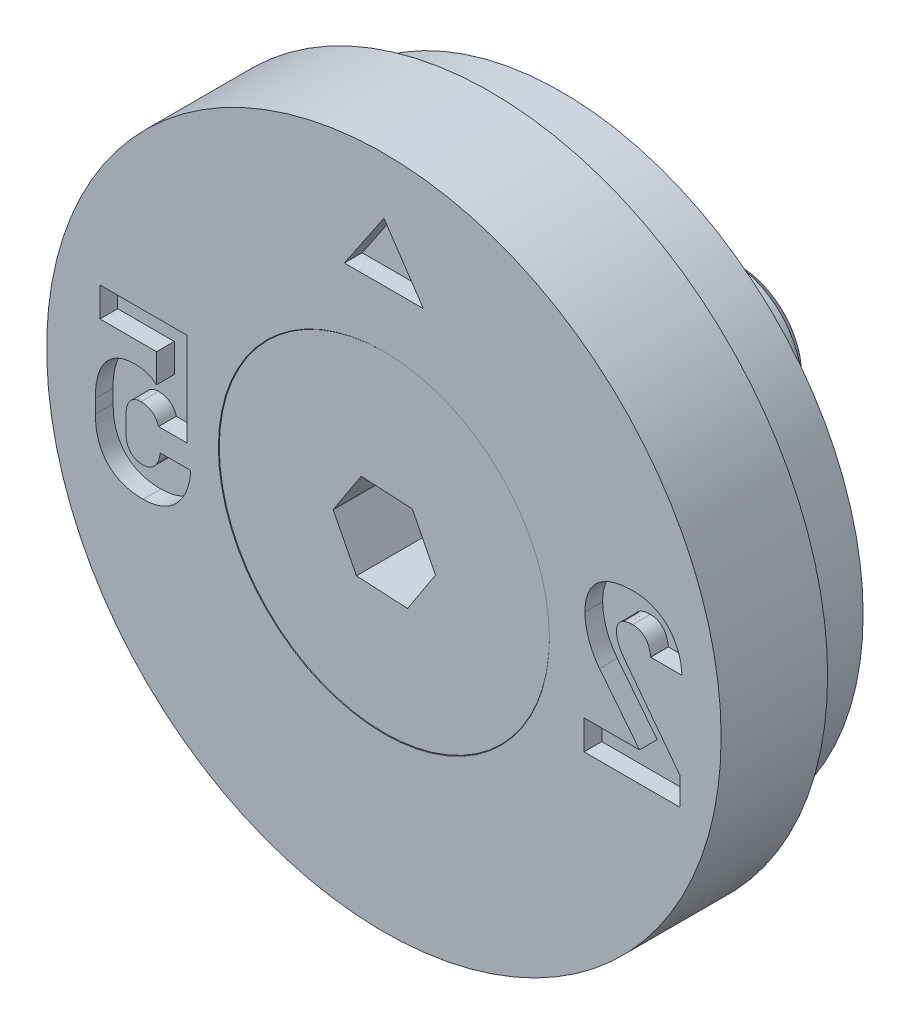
ISO-10303-21;
HEADER;
FILE_DESCRIPTION(('STEP AP214'),'2;1');
FILE_NAME('part.step','',(''),(''),'','','');
FILE_SCHEMA(('AUTOMOTIVE_DESIGN { 1 0 10303 214 1 1 1 1 }'));
ENDSEC;
DATA;
#1=APPLICATION_CONTEXT('core data for automotive mechanical design processes');
#2=APPLICATION_PROTOCOL_DEFINITION('international standard','automotive_design',2000,#1);
#3=PRODUCT_CONTEXT('',#1,'mechanical');
#4=PRODUCT('Part','Part','',(#3));
#5=PRODUCT_RELATED_PRODUCT_CATEGORY('part','',(#4));
#6=PRODUCT_DEFINITION_FORMATION('','',#4);
#7=PRODUCT_DEFINITION_CONTEXT('part definition',#1,'design');
#8=PRODUCT_DEFINITION('design','',#6,#7);
#9=PRODUCT_DEFINITION_SHAPE('','',#8);
#10=(LENGTH_UNIT() NAMED_UNIT(*) SI_UNIT(.MILLI.,.METRE.));
#11=(NAMED_UNIT(*) PLANE_ANGLE_UNIT() SI_UNIT($,.RADIAN.));
#12=(NAMED_UNIT(*) SI_UNIT($,.STERADIAN.) SOLID_ANGLE_UNIT());
#13=UNCERTAINTY_MEASURE_WITH_UNIT(LENGTH_MEASURE(1.E-05),#10,'distance_accuracy_value','');
#14=(GEOMETRIC_REPRESENTATION_CONTEXT(3) GLOBAL_UNCERTAINTY_ASSIGNED_CONTEXT((#13)) GLOBAL_UNIT_ASSIGNED_CONTEXT((#10,
#11,#12)) REPRESENTATION_CONTEXT('',''));
#15=CARTESIAN_POINT('',(0.,0.,0.));
#16=DIRECTION('',(0.,0.,1.));
#17=DIRECTION('',(1.,0.,0.));
#18=AXIS2_PLACEMENT_3D('',#15,#16,#17);
#19=CARTESIAN_POINT('',(0.,0.,-0.0130000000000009));
#20=DIRECTION('',(0.,0.,1.));
#21=DIRECTION('',(1.,0.,0.));
#22=AXIS2_PLACEMENT_3D('',#19,#20,#21);
#23=CYLINDRICAL_SURFACE('',#22,2.);
#24=CARTESIAN_POINT('',(0.,0.,-2.663));
#25=DIRECTION('',(0.,0.,1.));
#26=DIRECTION('',(1.,0.,0.));
#27=AXIS2_PLACEMENT_3D('',#24,#25,#26);
#28=CIRCLE('',#27,2.);
#29=CARTESIAN_POINT('',(2.,0.,-2.663));
#30=VERTEX_POINT('',#29);
#31=EDGE_CURVE('E12',#30,#30,#28,.T.);
#32=ORIENTED_EDGE('',*,*,#31,.F.);
#33=EDGE_LOOP('',(#32));
#34=FACE_BOUND('',#33,.T.);
#35=CARTESIAN_POINT('',(0.,0.,-9.763));
#36=DIRECTION('',(0.,0.,1.));
#37=DIRECTION('',(1.,0.,0.));
#38=AXIS2_PLACEMENT_3D('',#35,#36,#37);
#39=CIRCLE('',#38,2.);
#40=CARTESIAN_POINT('',(2.,0.,-9.763));
#41=VERTEX_POINT('',#40);
#42=EDGE_CURVE('E146',#41,#41,#39,.T.);
#43=ORIENTED_EDGE('',*,*,#42,.T.);
#44=EDGE_LOOP('',(#43));
#45=FACE_BOUND('',#44,.T.);
#46=ADVANCED_FACE('F45',(#34,#45),#23,.T.);
#47=CARTESIAN_POINT('',(0.,0.,-2.663));
#48=DIRECTION('',(0.,0.,1.));
#49=DIRECTION('',(1.,0.,0.));
#50=AXIS2_PLACEMENT_3D('',#47,#48,#49);
#51=CONICAL_SURFACE('',#50,2.,0.785398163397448);
#52=CARTESIAN_POINT('',(0.,0.,-0.0130000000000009));
#53=DIRECTION('',(0.,0.,1.));
#54=DIRECTION('',(1.,0.,0.));
#55=AXIS2_PLACEMENT_3D('',#52,#53,#54);
#56=CIRCLE('',#55,4.65);
#57=CARTESIAN_POINT('',(4.65,0.,-0.0130000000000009));
#58=VERTEX_POINT('',#57);
#59=EDGE_CURVE('E52',#58,#58,#56,.T.);
#60=ORIENTED_EDGE('',*,*,#59,.F.);
#61=EDGE_LOOP('',(#60));
#62=FACE_BOUND('',#61,.T.);
#63=ORIENTED_EDGE('',*,*,#31,.T.);
#64=EDGE_LOOP('',(#63));
#65=FACE_BOUND('',#64,.T.);
#66=ADVANCED_FACE('F161',(#62,#65),#51,.T.);
#67=CARTESIAN_POINT('',(0.,4.65,-0.0130000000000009));
#68=DIRECTION('',(0.,0.,-1.));
#69=DIRECTION('',(-1.,0.,0.));
#70=AXIS2_PLACEMENT_3D('',#67,#68,#69);
#71=PLANE('',#70);
#72=DIRECTION('',(0.99860351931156,-0.0528300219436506,0.));
#73=VECTOR('',#72,1.);
#74=CARTESIAN_POINT('',(-0.786717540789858,-1.21012761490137,-0.0130000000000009));
#75=LINE('',#74,#73);
#76=CARTESIAN_POINT('',(-0.786717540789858,-1.21012761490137,-0.0130000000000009));
#77=VERTEX_POINT('',#76);
#78=CARTESIAN_POINT('',(0.654642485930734,-1.28638118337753,-0.0130000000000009));
#79=VERTEX_POINT('',#78);
#80=EDGE_CURVE('E133',#77,#79,#75,.T.);
#81=ORIENTED_EDGE('',*,*,#80,.F.);
#82=DIRECTION('',(0.453549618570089,-0.891231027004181,0.));
#83=VECTOR('',#82,1.);
#84=CARTESIAN_POINT('',(-1.44136002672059,0.076253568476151,-0.0130000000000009));
#85=LINE('',#84,#83);
#86=CARTESIAN_POINT('',(-1.44136002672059,0.076253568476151,-0.0130000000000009));
#87=VERTEX_POINT('',#86);
#88=EDGE_CURVE('E59',#87,#77,#85,.T.);
#89=ORIENTED_EDGE('',*,*,#88,.F.);
#90=DIRECTION('',(-0.545053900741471,-0.83840100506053,0.));
#91=VECTOR('',#90,1.);
#92=CARTESIAN_POINT('',(-0.654642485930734,1.28638118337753,-0.0130000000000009));
#93=LINE('',#92,#91);
#94=CARTESIAN_POINT('',(-0.654642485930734,1.28638118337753,-0.0130000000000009));
#95=VERTEX_POINT('',#94);
#96=EDGE_CURVE('E142',#95,#87,#93,.T.);
#97=ORIENTED_EDGE('',*,*,#96,.F.);
#98=DIRECTION('',(-0.99860351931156,0.0528300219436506,0.));
#99=VECTOR('',#98,1.);
#100=CARTESIAN_POINT('',(0.786717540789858,1.21012761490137,-0.0130000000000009));
#101=LINE('',#100,#99);
#102=CARTESIAN_POINT('',(0.786717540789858,1.21012761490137,-0.0130000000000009));
#103=VERTEX_POINT('',#102);
#104=EDGE_CURVE('E140',#103,#95,#101,.T.);
#105=ORIENTED_EDGE('',*,*,#104,.F.);
#106=DIRECTION('',(-0.45354961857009,0.891231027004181,0.));
#107=VECTOR('',#106,1.);
#108=CARTESIAN_POINT('',(1.44136002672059,-0.0762535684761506,-0.0130000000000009));
#109=LINE('',#108,#107);
#110=CARTESIAN_POINT('',(1.44136002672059,-0.0762535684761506,-0.0130000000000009));
#111=VERTEX_POINT('',#110);
#112=EDGE_CURVE('E107',#111,#103,#109,.T.);
#113=ORIENTED_EDGE('',*,*,#112,.F.);
#114=DIRECTION('',(0.545053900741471,0.83840100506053,0.));
#115=VECTOR('',#114,1.);
#116=CARTESIAN_POINT('',(0.654642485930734,-1.28638118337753,-0.0130000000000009));
#117=LINE('',#116,#115);
#118=EDGE_CURVE('E136',#79,#111,#117,.T.);
#119=ORIENTED_EDGE('',*,*,#118,.F.);
#120=EDGE_LOOP('',(#81,#89,#97,#105,#113,#119));
#121=FACE_BOUND('',#120,.T.);
#122=ORIENTED_EDGE('',*,*,#59,.T.);
#123=EDGE_LOOP('',(#122));
#124=FACE_BOUND('',#123,.T.);
#125=ADVANCED_FACE('F159',(#121,#124),#71,.F.);
#126=CARTESIAN_POINT('',(0.,0.,-10.013));
#127=DIRECTION('',(0.,0.,1.));
#128=DIRECTION('',(1.,0.,0.));
#129=AXIS2_PLACEMENT_3D('',#126,#127,#128);
#130=PLANE('',#129);
#131=CARTESIAN_POINT('',(0.,0.,-10.013));
#132=DIRECTION('',(0.,0.,1.));
#133=DIRECTION('',(1.,0.,0.));
#134=AXIS2_PLACEMENT_3D('',#131,#132,#133);
#135=CIRCLE('',#134,1.75);
#136=CARTESIAN_POINT('',(1.75,0.,-10.013));
#137=VERTEX_POINT('',#136);
#138=EDGE_CURVE('E154',#137,#137,#135,.T.);
#139=ORIENTED_EDGE('',*,*,#138,.F.);
#140=EDGE_LOOP('',(#139));
#141=FACE_BOUND('',#140,.T.);
#142=ADVANCED_FACE('F174',(#141),#130,.F.);
#143=CARTESIAN_POINT('',(0.,0.,-10.013));
#144=DIRECTION('',(0.,0.,1.));
#145=DIRECTION('',(1.,0.,0.));
#146=AXIS2_PLACEMENT_3D('',#143,#144,#145);
#147=CONICAL_SURFACE('',#146,1.75,0.78539816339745);
#148=ORIENTED_EDGE('',*,*,#42,.F.);
#149=EDGE_LOOP('',(#148));
#150=FACE_BOUND('',#149,.T.);
#151=ORIENTED_EDGE('',*,*,#138,.T.);
#152=EDGE_LOOP('',(#151));
#153=FACE_BOUND('',#152,.T.);
#154=ADVANCED_FACE('F170',(#150,#153),#147,.T.);
#155=CARTESIAN_POINT('',(-1.44136002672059,0.076253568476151,-2.013));
#156=DIRECTION('',(-0.891231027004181,-0.453549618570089,0.));
#157=DIRECTION('',(0.453549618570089,-0.891231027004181,0.));
#158=AXIS2_PLACEMENT_3D('',#155,#156,#157);
#159=PLANE('',#158);
#160=ORIENTED_EDGE('',*,*,#88,.T.);
#161=DIRECTION('',(0.,0.,1.));
#162=VECTOR('',#161,1.);
#163=CARTESIAN_POINT('',(-0.786717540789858,-1.21012761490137,-2.013));
#164=LINE('',#163,#162);
#165=CARTESIAN_POINT('',(-0.786717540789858,-1.21012761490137,-2.013));
#166=VERTEX_POINT('',#165);
#167=EDGE_CURVE('E89',#166,#77,#164,.T.);
#168=ORIENTED_EDGE('',*,*,#167,.F.);
#169=DIRECTION('',(0.453549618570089,-0.891231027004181,0.));
#170=VECTOR('',#169,1.);
#171=CARTESIAN_POINT('',(-1.44136002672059,0.076253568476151,-2.013));
#172=LINE('',#171,#170);
#173=CARTESIAN_POINT('',(-1.44136002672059,0.076253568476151,-2.013));
#174=VERTEX_POINT('',#173);
#175=EDGE_CURVE('E144',#174,#166,#172,.T.);
#176=ORIENTED_EDGE('',*,*,#175,.F.);
#177=DIRECTION('',(0.,0.,1.));
#178=VECTOR('',#177,1.);
#179=CARTESIAN_POINT('',(-1.44136002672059,0.076253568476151,-2.013));
#180=LINE('',#179,#178);
#181=EDGE_CURVE('E67',#174,#87,#180,.T.);
#182=ORIENTED_EDGE('',*,*,#181,.T.);
#183=EDGE_LOOP('',(#160,#168,#176,#182));
#184=FACE_BOUND('',#183,.T.);
#185=ADVANCED_FACE('F173',(#184),#159,.F.);
#186=CARTESIAN_POINT('',(-0.654642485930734,1.28638118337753,-2.013));
#187=DIRECTION('',(-0.83840100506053,0.545053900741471,0.));
#188=DIRECTION('',(-0.54505390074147,-0.83840100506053,0.));
#189=AXIS2_PLACEMENT_3D('',#186,#187,#188);
#190=PLANE('',#189);
#191=ORIENTED_EDGE('',*,*,#96,.T.);
#192=ORIENTED_EDGE('',*,*,#181,.F.);
#193=DIRECTION('',(-0.545053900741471,-0.83840100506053,0.));
#194=VECTOR('',#193,1.);
#195=CARTESIAN_POINT('',(-0.654642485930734,1.28638118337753,-2.013));
#196=LINE('',#195,#194);
#197=CARTESIAN_POINT('',(-0.654642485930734,1.28638118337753,-2.013));
#198=VERTEX_POINT('',#197);
#199=EDGE_CURVE('E119',#198,#174,#196,.T.);
#200=ORIENTED_EDGE('',*,*,#199,.F.);
#201=DIRECTION('',(0.,0.,1.));
#202=VECTOR('',#201,1.);
#203=CARTESIAN_POINT('',(-0.654642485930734,1.28638118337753,-2.013));
#204=LINE('',#203,#202);
#205=EDGE_CURVE('E111',#198,#95,#204,.T.);
#206=ORIENTED_EDGE('',*,*,#205,.T.);
#207=EDGE_LOOP('',(#191,#192,#200,#206));
#208=FACE_BOUND('',#207,.T.);
#209=ADVANCED_FACE('F189',(#208),#190,.F.);
#210=CARTESIAN_POINT('',(0.786717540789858,1.21012761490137,-2.013));
#211=DIRECTION('',(0.0528300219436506,0.99860351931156,0.));
#212=DIRECTION('',(-0.99860351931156,0.0528300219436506,0.));
#213=AXIS2_PLACEMENT_3D('',#210,#211,#212);
#214=PLANE('',#213);
#215=ORIENTED_EDGE('',*,*,#104,.T.);
#216=ORIENTED_EDGE('',*,*,#205,.F.);
#217=DIRECTION('',(-0.99860351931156,0.0528300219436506,0.));
#218=VECTOR('',#217,1.);
#219=CARTESIAN_POINT('',(0.786717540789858,1.21012761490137,-2.013));
#220=LINE('',#219,#218);
#221=CARTESIAN_POINT('',(0.786717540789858,1.21012761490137,-2.013));
#222=VERTEX_POINT('',#221);
#223=EDGE_CURVE('E115',#222,#198,#220,.T.);
#224=ORIENTED_EDGE('',*,*,#223,.F.);
#225=DIRECTION('',(0.,0.,1.));
#226=VECTOR('',#225,1.);
#227=CARTESIAN_POINT('',(0.786717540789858,1.21012761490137,-2.013));
#228=LINE('',#227,#226);
#229=EDGE_CURVE('E100',#222,#103,#228,.T.);
#230=ORIENTED_EDGE('',*,*,#229,.T.);
#231=EDGE_LOOP('',(#215,#216,#224,#230));
#232=FACE_BOUND('',#231,.T.);
#233=ADVANCED_FACE('F116',(#232),#214,.F.);
#234=CARTESIAN_POINT('',(1.44136002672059,-0.0762535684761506,-2.013));
#235=DIRECTION('',(0.89123102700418,0.45354961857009,0.));
#236=DIRECTION('',(-0.45354961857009,0.891231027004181,0.));
#237=AXIS2_PLACEMENT_3D('',#234,#235,#236);
#238=PLANE('',#237);
#239=ORIENTED_EDGE('',*,*,#112,.T.);
#240=ORIENTED_EDGE('',*,*,#229,.F.);
#241=DIRECTION('',(-0.45354961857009,0.891231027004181,0.));
#242=VECTOR('',#241,1.);
#243=CARTESIAN_POINT('',(1.44136002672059,-0.0762535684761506,-2.013));
#244=LINE('',#243,#242);
#245=CARTESIAN_POINT('',(1.44136002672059,-0.0762535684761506,-2.013));
#246=VERTEX_POINT('',#245);
#247=EDGE_CURVE('E104',#246,#222,#244,.T.);
#248=ORIENTED_EDGE('',*,*,#247,.F.);
#249=DIRECTION('',(0.,0.,1.));
#250=VECTOR('',#249,1.);
#251=CARTESIAN_POINT('',(1.44136002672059,-0.0762535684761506,-2.013));
#252=LINE('',#251,#250);
#253=EDGE_CURVE('E112',#246,#111,#252,.T.);
#254=ORIENTED_EDGE('',*,*,#253,.T.);
#255=EDGE_LOOP('',(#239,#240,#248,#254));
#256=FACE_BOUND('',#255,.T.);
#257=ADVANCED_FACE('F102',(#256),#238,.F.);
#258=CARTESIAN_POINT('',(0.654642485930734,-1.28638118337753,-2.013));
#259=DIRECTION('',(0.83840100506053,-0.545053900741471,0.));
#260=DIRECTION('',(0.54505390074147,0.83840100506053,0.));
#261=AXIS2_PLACEMENT_3D('',#258,#259,#260);
#262=PLANE('',#261);
#263=ORIENTED_EDGE('',*,*,#118,.T.);
#264=ORIENTED_EDGE('',*,*,#253,.F.);
#265=DIRECTION('',(0.545053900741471,0.83840100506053,0.));
#266=VECTOR('',#265,1.);
#267=CARTESIAN_POINT('',(0.654642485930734,-1.28638118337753,-2.013));
#268=LINE('',#267,#266);
#269=CARTESIAN_POINT('',(0.654642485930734,-1.28638118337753,-2.013));
#270=VERTEX_POINT('',#269);
#271=EDGE_CURVE('E125',#270,#246,#268,.T.);
#272=ORIENTED_EDGE('',*,*,#271,.F.);
#273=DIRECTION('',(0.,0.,1.));
#274=VECTOR('',#273,1.);
#275=CARTESIAN_POINT('',(0.654642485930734,-1.28638118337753,-2.013));
#276=LINE('',#275,#274);
#277=EDGE_CURVE('E149',#270,#79,#276,.T.);
#278=ORIENTED_EDGE('',*,*,#277,.T.);
#279=EDGE_LOOP('',(#263,#264,#272,#278));
#280=FACE_BOUND('',#279,.T.);
#281=ADVANCED_FACE('F193',(#280),#262,.F.);
#282=CARTESIAN_POINT('',(-0.786717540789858,-1.21012761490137,-2.013));
#283=DIRECTION('',(-0.0528300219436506,-0.99860351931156,0.));
#284=DIRECTION('',(0.99860351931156,-0.0528300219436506,0.));
#285=AXIS2_PLACEMENT_3D('',#282,#283,#284);
#286=PLANE('',#285);
#287=ORIENTED_EDGE('',*,*,#80,.T.);
#288=ORIENTED_EDGE('',*,*,#277,.F.);
#289=DIRECTION('',(0.99860351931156,-0.0528300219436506,0.));
#290=VECTOR('',#289,1.);
#291=CARTESIAN_POINT('',(-0.786717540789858,-1.21012761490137,-2.013));
#292=LINE('',#291,#290);
#293=EDGE_CURVE('E127',#166,#270,#292,.T.);
#294=ORIENTED_EDGE('',*,*,#293,.F.);
#295=ORIENTED_EDGE('',*,*,#167,.T.);
#296=EDGE_LOOP('',(#287,#288,#294,#295));
#297=FACE_BOUND('',#296,.T.);
#298=ADVANCED_FACE('F190',(#297),#286,.F.);
#299=CARTESIAN_POINT('',(0.,0.,-2.013));
#300=DIRECTION('',(0.,0.,1.));
#301=DIRECTION('',(1.,0.,0.));
#302=AXIS2_PLACEMENT_3D('',#299,#300,#301);
#303=PLANE('',#302);
#304=ORIENTED_EDGE('',*,*,#175,.T.);
#305=ORIENTED_EDGE('',*,*,#293,.T.);
#306=ORIENTED_EDGE('',*,*,#271,.T.);
#307=ORIENTED_EDGE('',*,*,#247,.T.);
#308=ORIENTED_EDGE('',*,*,#223,.T.);
#309=ORIENTED_EDGE('',*,*,#199,.T.);
#310=EDGE_LOOP('',(#304,#305,#306,#307,#308,#309));
#311=FACE_BOUND('',#310,.T.);
#312=ADVANCED_FACE('F122',(#311),#303,.T.);
#313=CLOSED_SHELL('',(#46,#66,#125,#142,#154,#185,#209,#233,#257,#281,#298,#312));
#314=MANIFOLD_SOLID_BREP('B2',#313);
#315=CARTESIAN_POINT('',(0.,0.,3.12219627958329));
#316=DIRECTION('',(0.,0.,1.));
#317=DIRECTION('',(1.,0.,0.));
#318=AXIS2_PLACEMENT_3D('',#315,#316,#317);
#319=CYLINDRICAL_SURFACE('',#318,9.5);
#320=CARTESIAN_POINT('',(0.,0.,0.));
#321=DIRECTION('',(0.,0.,1.));
#322=DIRECTION('',(1.,0.,0.));
#323=AXIS2_PLACEMENT_3D('',#320,#321,#322);
#324=CIRCLE('',#323,9.5);
#325=CARTESIAN_POINT('',(9.5,0.,0.));
#326=VERTEX_POINT('',#325);
#327=EDGE_CURVE('E43',#326,#326,#324,.T.);
#328=ORIENTED_EDGE('',*,*,#327,.F.);
#329=EDGE_LOOP('',(#328));
#330=FACE_BOUND('',#329,.T.);
#331=CARTESIAN_POINT('',(0.,0.,-3.));
#332=DIRECTION('',(0.,0.,1.));
#333=DIRECTION('',(1.,0.,0.));
#334=AXIS2_PLACEMENT_3D('',#331,#332,#333);
#335=CIRCLE('',#334,9.5);
#336=CARTESIAN_POINT('',(9.5,0.,-3.));
#337=VERTEX_POINT('',#336);
#338=EDGE_CURVE('E745',#337,#337,#335,.T.);
#339=ORIENTED_EDGE('',*,*,#338,.T.);
#340=EDGE_LOOP('',(#339));
#341=FACE_BOUND('',#340,.T.);
#342=ADVANCED_FACE('F256',(#330,#341),#319,.T.);
#343=CARTESIAN_POINT('',(0.,9.5,0.));
#344=DIRECTION('',(0.,0.,-1.));
#345=DIRECTION('',(-1.,0.,0.));
#346=AXIS2_PLACEMENT_3D('',#343,#344,#345);
#347=PLANE('',#346);
#348=DIRECTION('',(-0.605393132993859,0.795926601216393,0.));
#349=VECTOR('',#348,1.);
#350=CARTESIAN_POINT('',(8.34140909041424,-1.50893702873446,0.));
#351=LINE('',#350,#349);
#352=CARTESIAN_POINT('',(8.34140909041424,-1.50893702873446,0.));
#353=VERTEX_POINT('',#352);
#354=CARTESIAN_POINT('',(6.77237546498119,0.553913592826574,0.));
#355=VERTEX_POINT('',#354);
#356=EDGE_CURVE('E1207',#353,#355,#351,.T.);
#357=ORIENTED_EDGE('',*,*,#356,.F.);
#358=DIRECTION('',(0.,1.,0.));
#359=VECTOR('',#358,1.);
#360=CARTESIAN_POINT('',(8.34140909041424,-2.286,0.));
#361=LINE('',#360,#359);
#362=CARTESIAN_POINT('',(8.34140909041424,-2.286,0.));
#363=VERTEX_POINT('',#362);
#364=EDGE_CURVE('E270',#363,#353,#361,.T.);
#365=ORIENTED_EDGE('',*,*,#364,.F.);
#366=DIRECTION('',(1.,0.,0.));
#367=VECTOR('',#366,1.);
#368=CARTESIAN_POINT('',(5.6375281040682,-2.286,0.));
#369=LINE('',#368,#367);
#370=CARTESIAN_POINT('',(5.6375281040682,-2.286,0.));
#371=VERTEX_POINT('',#370);
#372=EDGE_CURVE('E527',#371,#363,#369,.T.);
#373=ORIENTED_EDGE('',*,*,#372,.F.);
#374=DIRECTION('',(0.,-1.,0.));
#375=VECTOR('',#374,1.);
#376=CARTESIAN_POINT('',(5.6375281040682,-1.45582840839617,0.));
#377=LINE('',#376,#375);
#378=CARTESIAN_POINT('',(5.6375281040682,-1.45582840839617,0.));
#379=VERTEX_POINT('',#378);
#380=EDGE_CURVE('E530',#379,#371,#377,.T.);
#381=ORIENTED_EDGE('',*,*,#380,.F.);
#382=DIRECTION('',(-1.,0.,0.));
#383=VECTOR('',#382,1.);
#384=CARTESIAN_POINT('',(7.20003961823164,-1.45582840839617,0.));
#385=LINE('',#384,#383);
#386=CARTESIAN_POINT('',(7.20003961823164,-1.45582840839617,0.));
#387=VERTEX_POINT('',#386);
#388=EDGE_CURVE('E1275',#387,#379,#385,.T.);
#389=ORIENTED_EDGE('',*,*,#388,.F.);
#390=DIRECTION('',(0.620676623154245,-0.78406666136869,0.));
#391=VECTOR('',#390,1.);
#392=CARTESIAN_POINT('',(6.0745095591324,-0.0340081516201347,0.));
#393=LINE('',#392,#391);
#394=CARTESIAN_POINT('',(6.0745095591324,-0.0340081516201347,0.));
#395=VERTEX_POINT('',#394);
#396=EDGE_CURVE('E1269',#395,#387,#393,.T.);
#397=ORIENTED_EDGE('',*,*,#396,.F.);
#398=CARTESIAN_POINT('',(5.66268481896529,1.13810841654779,0.));
#399=CARTESIAN_POINT('',(5.66387933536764,1.08617657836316,0.));
#400=CARTESIAN_POINT('',(5.66627054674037,0.982218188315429,0.));
#401=CARTESIAN_POINT('',(5.68759705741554,0.826907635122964,0.));
#402=CARTESIAN_POINT('',(5.72246906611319,0.67249443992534,0.));
#403=CARTESIAN_POINT('',(5.76978568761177,0.519519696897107,0.));
#404=CARTESIAN_POINT('',(5.8288710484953,0.370537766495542,0.));
#405=CARTESIAN_POINT('',(5.89938536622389,0.227922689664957,0.));
#406=CARTESIAN_POINT('',(5.97989142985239,0.0920384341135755,0.));
#407=CARTESIAN_POINT('',(6.04297459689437,0.0080014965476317,0.));
#408=CARTESIAN_POINT('',(6.0745095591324,-0.0340081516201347,0.));
#409=B_SPLINE_CURVE_WITH_KNOTS('',3,(#398,#399,#400,#401,#402,#403,#404,#405,#406,#407,#408),
.UNSPECIFIED.,.F.,.F.,(4,1,1,1,1,1,1,1,4),(0.,0.123148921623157,0.24652244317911,
0.371108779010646,0.498350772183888,0.625999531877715,0.750879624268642,0.875465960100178,1.),.UNSPECIFIED.);
#410=CARTESIAN_POINT('',(5.66268481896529,1.13810841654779,0.));
#411=VERTEX_POINT('',#410);
#412=EDGE_CURVE('E1264',#411,#395,#409,.T.);
#413=ORIENTED_EDGE('',*,*,#412,.F.);
#414=DIRECTION('',(0.,-1.,0.));
#415=VECTOR('',#414,1.);
#416=CARTESIAN_POINT('',(5.66268481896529,1.14183533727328,0.));
#417=LINE('',#416,#415);
#418=CARTESIAN_POINT('',(5.66268481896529,1.14183533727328,0.));
#419=VERTEX_POINT('',#418);
#420=EDGE_CURVE('E1258',#419,#411,#417,.T.);
#421=ORIENTED_EDGE('',*,*,#420,.F.);
#422=CARTESIAN_POINT('',(7.01462531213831,2.33351823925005,0.));
#423=CARTESIAN_POINT('',(6.94590232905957,2.33208156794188,0.));
#424=CARTESIAN_POINT('',(6.8128931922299,2.32930097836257,0.));
#425=CARTESIAN_POINT('',(6.62136896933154,2.30312490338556,0.));
#426=CARTESIAN_POINT('',(6.44525913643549,2.25956490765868,0.));
#427=CARTESIAN_POINT('',(6.28500551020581,2.19836482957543,0.));
#428=CARTESIAN_POINT('',(6.14166040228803,2.11969362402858,0.));
#429=CARTESIAN_POINT('',(6.01456040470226,2.02631221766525,0.));
#430=CARTESIAN_POINT('',(5.90729415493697,1.91459553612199,0.));
#431=CARTESIAN_POINT('',(5.8180698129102,1.78768371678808,0.));
#432=CARTESIAN_POINT('',(5.74773367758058,1.64606647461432,0.));
#433=CARTESIAN_POINT('',(5.69847751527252,1.48986595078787,0.));
#434=CARTESIAN_POINT('',(5.66831272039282,1.3203368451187,0.));
#435=CARTESIAN_POINT('',(5.66459835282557,1.20252735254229,0.));
#436=CARTESIAN_POINT('',(5.66268481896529,1.14183533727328,0.));
#437=B_SPLINE_CURVE_WITH_KNOTS('',3,(#422,#423,#424,#425,#426,#427,#428,#429,#430,#431,#432,
#433,#434,#435,#436),.UNSPECIFIED.,.F.,.F.,(4,1,1,1,1,1,1,1,1,1,1,1,4),(0.,0.100715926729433,
0.194929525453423,0.282728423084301,0.366191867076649,0.44566981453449,0.521804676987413,
0.596515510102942,0.671682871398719,0.748455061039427,0.827368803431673,0.911065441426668,1.),.UNSPECIFIED.);
#438=CARTESIAN_POINT('',(7.01462531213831,2.33351823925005,0.));
#439=VERTEX_POINT('',#438);
#440=EDGE_CURVE('E1250',#439,#419,#437,.T.);
#441=ORIENTED_EDGE('',*,*,#440,.F.);
#442=CARTESIAN_POINT('',(8.39824463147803,0.965738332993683,0.));
#443=CARTESIAN_POINT('',(8.39191583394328,1.0345689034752,0.));
#444=CARTESIAN_POINT('',(8.37958695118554,1.16865504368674,0.));
#445=CARTESIAN_POINT('',(8.33766526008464,1.36148165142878,0.));
#446=CARTESIAN_POINT('',(8.27573476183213,1.53891106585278,0.));
#447=CARTESIAN_POINT('',(8.19660994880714,1.70143301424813,0.));
#448=CARTESIAN_POINT('',(8.09958912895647,1.84699580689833,0.));
#449=CARTESIAN_POINT('',(7.98701611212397,1.97556020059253,0.));
#450=CARTESIAN_POINT('',(7.85764408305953,2.08462899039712,0.));
#451=CARTESIAN_POINT('',(7.71371394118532,2.17526096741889,0.));
#452=CARTESIAN_POINT('',(7.55585434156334,2.24618966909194,0.));
#453=CARTESIAN_POINT('',(7.38599582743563,2.29786894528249,0.));
#454=CARTESIAN_POINT('',(7.20388257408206,2.32766147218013,0.));
#455=CARTESIAN_POINT('',(7.07871263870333,2.33153498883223,0.));
#456=CARTESIAN_POINT('',(7.01462531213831,2.33351823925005,0.));
#457=B_SPLINE_CURVE_WITH_KNOTS('',3,(#442,#443,#444,#445,#446,#447,#448,#449,#450,#451,#452,
#453,#454,#455,#456),.UNSPECIFIED.,.F.,.F.,(4,1,1,1,1,1,1,1,1,1,1,1,4),(0.,0.0953291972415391,
0.185707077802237,0.271513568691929,0.35413169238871,0.434493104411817,0.512233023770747,
0.58917600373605,0.667186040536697,0.746219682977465,0.827302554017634,0.911578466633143,1.),.UNSPECIFIED.);
#458=CARTESIAN_POINT('',(8.39824463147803,0.965738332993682,0.));
#459=VERTEX_POINT('',#458);
#460=EDGE_CURVE('E1245',#459,#439,#457,.T.);
#461=ORIENTED_EDGE('',*,*,#460,.F.);
#462=DIRECTION('',(0.,1.,0.));
#463=VECTOR('',#462,1.);
#464=CARTESIAN_POINT('',(8.39824463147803,0.962011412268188,0.));
#465=LINE('',#464,#463);
#466=CARTESIAN_POINT('',(8.39824463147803,0.962011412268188,0.));
#467=VERTEX_POINT('',#466);
#468=EDGE_CURVE('E1242',#467,#459,#465,.T.);
#469=ORIENTED_EDGE('',*,*,#468,.F.);
#470=DIRECTION('',(1.,0.,0.));
#471=VECTOR('',#470,1.);
#472=CARTESIAN_POINT('',(7.5149644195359,0.962011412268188,0.));
#473=LINE('',#472,#471);
#474=CARTESIAN_POINT('',(7.5149644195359,0.962011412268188,0.));
#475=VERTEX_POINT('',#474);
#476=EDGE_CURVE('E1239',#475,#467,#473,.T.);
#477=ORIENTED_EDGE('',*,*,#476,.F.);
#478=DIRECTION('',(0.,-1.,0.));
#479=VECTOR('',#478,1.);
#480=CARTESIAN_POINT('',(7.5149644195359,0.965738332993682,0.));
#481=LINE('',#480,#479);
#482=CARTESIAN_POINT('',(7.5149644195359,0.965738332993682,0.));
#483=VERTEX_POINT('',#482);
#484=EDGE_CURVE('E1233',#483,#475,#481,.T.);
#485=ORIENTED_EDGE('',*,*,#484,.F.);
#486=CARTESIAN_POINT('',(7.0081032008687,1.50334664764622,0.));
#487=CARTESIAN_POINT('',(7.04212896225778,1.50190936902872,0.));
#488=CARTESIAN_POINT('',(7.10816219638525,1.49912006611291,0.));
#489=CARTESIAN_POINT('',(7.20209495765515,1.47254081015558,0.));
#490=CARTESIAN_POINT('',(7.28553861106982,1.42741685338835,0.));
#491=CARTESIAN_POINT('',(7.35777259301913,1.36505446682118,0.));
#492=CARTESIAN_POINT('',(7.41838344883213,1.28660246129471,0.));
#493=CARTESIAN_POINT('',(7.46305815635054,1.19209335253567,0.));
#494=CARTESIAN_POINT('',(7.4990354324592,1.08467972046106,0.));
#495=CARTESIAN_POINT('',(7.50947598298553,1.0067203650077,0.));
#496=CARTESIAN_POINT('',(7.5149644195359,0.965738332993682,0.));
#497=B_SPLINE_CURVE_WITH_KNOTS('',3,(#486,#487,#488,#489,#490,#491,#492,#493,#494,#495,#496),
.UNSPECIFIED.,.F.,.F.,(4,1,1,1,1,1,1,1,4),(0.,0.124212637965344,0.24105741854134,
0.353359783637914,0.468536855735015,0.587568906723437,0.713021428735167,0.849139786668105,1.),.UNSPECIFIED.);
#498=CARTESIAN_POINT('',(7.0081032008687,1.50334664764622,0.));
#499=VERTEX_POINT('',#498);
#500=EDGE_CURVE('E1225',#499,#483,#497,.T.);
#501=ORIENTED_EDGE('',*,*,#500,.F.);
#502=CARTESIAN_POINT('',(6.54969195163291,1.1166786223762,0.));
#503=CARTESIAN_POINT('',(6.55094235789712,1.14603676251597,0.));
#504=CARTESIAN_POINT('',(6.55332521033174,1.20198347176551,0.));
#505=CARTESIAN_POINT('',(6.57632949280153,1.28069475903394,0.));
#506=CARTESIAN_POINT('',(6.61436945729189,1.34875851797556,0.));
#507=CARTESIAN_POINT('',(6.6676531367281,1.40581525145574,0.));
#508=CARTESIAN_POINT('',(6.73543030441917,1.44966598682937,0.));
#509=CARTESIAN_POINT('',(6.81537777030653,1.48169861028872,0.));
#510=CARTESIAN_POINT('',(6.90792039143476,1.49982306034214,0.));
#511=CARTESIAN_POINT('',(6.97354899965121,1.50213132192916,0.));
#512=CARTESIAN_POINT('',(7.0081032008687,1.50334664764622,0.));
#513=B_SPLINE_CURVE_WITH_KNOTS('',3,(#502,#503,#504,#505,#506,#507,#508,#509,#510,#511,#512),
.UNSPECIFIED.,.F.,.F.,(4,1,1,1,1,1,1,1,4),(0.,0.129170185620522,0.246154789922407,
0.357734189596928,0.470108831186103,0.586692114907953,0.710769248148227,0.847716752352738,1.),.UNSPECIFIED.);
#514=CARTESIAN_POINT('',(6.54969195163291,1.1166786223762,0.));
#515=VERTEX_POINT('',#514);
#516=EDGE_CURVE('E1220',#515,#499,#513,.T.);
#517=ORIENTED_EDGE('',*,*,#516,.F.);
#518=DIRECTION('',(0.,1.,0.));
#519=VECTOR('',#518,1.);
#520=CARTESIAN_POINT('',(6.54969195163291,1.11015651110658,0.));
#521=LINE('',#520,#519);
#522=CARTESIAN_POINT('',(6.54969195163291,1.11015651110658,0.));
#523=VERTEX_POINT('',#522);
#524=EDGE_CURVE('E1214',#523,#515,#521,.T.);
#525=ORIENTED_EDGE('',*,*,#524,.F.);
#526=CARTESIAN_POINT('',(6.77237546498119,0.553913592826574,0.));
#527=CARTESIAN_POINT('',(6.73946856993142,0.599568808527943,0.));
#528=CARTESIAN_POINT('',(6.67522746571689,0.688697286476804,0.));
#529=CARTESIAN_POINT('',(6.61775152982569,0.811630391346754,0.));
#530=CARTESIAN_POINT('',(6.58123894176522,0.908022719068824,0.));
#531=CARTESIAN_POINT('',(6.5643584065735,0.977944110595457,0.));
#532=CARTESIAN_POINT('',(6.55186214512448,1.04480473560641,0.));
#533=CARTESIAN_POINT('',(6.55040540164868,1.08867214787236,0.));
#534=CARTESIAN_POINT('',(6.54969195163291,1.11015651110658,0.));
#535=B_SPLINE_CURVE_WITH_KNOTS('',3,(#526,#527,#528,#529,#530,#531,#532,#533,#534),
.UNSPECIFIED.,.F.,.F.,(4,1,1,1,1,1,4),(0.,0.276737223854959,0.540248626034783,0.66563356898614,
0.784034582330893,0.894229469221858,1.),.UNSPECIFIED.);
#536=EDGE_CURVE('E1209',#355,#523,#535,.T.);
#537=ORIENTED_EDGE('',*,*,#536,.F.);
#538=EDGE_LOOP('',(#357,#365,#373,#381,#389,#397,#413,#421,#441,#461,#469,#477,#485,#501,#517,
#525,#537));
#539=FACE_BOUND('',#538,.T.);
#540=CARTESIAN_POINT('',(-6.78243521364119,-2.33351823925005,0.));
#541=CARTESIAN_POINT('',(-6.72234546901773,-2.33168498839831,0.));
#542=CARTESIAN_POINT('',(-6.6047601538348,-2.32809763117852,0.));
#543=CARTESIAN_POINT('',(-6.43336256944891,-2.29589304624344,0.));
#544=CARTESIAN_POINT('',(-6.27087208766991,-2.24601841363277,0.));
#545=CARTESIAN_POINT('',(-6.11849698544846,-2.17486885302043,0.));
#546=CARTESIAN_POINT('',(-5.97789297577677,-2.08447545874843,0.));
#547=CARTESIAN_POINT('',(-5.85216852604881,-1.97393991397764,0.));
#548=CARTESIAN_POINT('',(-5.74017045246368,-1.84615623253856,0.));
#549=CARTESIAN_POINT('',(-5.64414459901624,-1.70000583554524,0.));
#550=CARTESIAN_POINT('',(-5.56506345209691,-1.53705222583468,0.));
#551=CARTESIAN_POINT('',(-5.50349739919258,-1.3592159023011,0.));
#552=CARTESIAN_POINT('',(-5.46121141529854,-1.1668165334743,0.));
#553=CARTESIAN_POINT('',(-5.44891820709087,-1.03333324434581,0.));
#554=CARTESIAN_POINT('',(-5.44260721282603,-0.964806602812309,0.));
#555=B_SPLINE_CURVE_WITH_KNOTS('',3,(#540,#541,#542,#543,#544,#545,#546,#547,#548,#549,#550,
#551,#552,#553,#554),.UNSPECIFIED.,.F.,.F.,(4,1,1,1,1,1,1,1,1,1,1,1,4),(0.,0.0844304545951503,
0.165215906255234,0.244369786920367,0.322918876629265,0.400936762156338,0.47863123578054,
0.557558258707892,0.639203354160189,0.723781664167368,0.811629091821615,0.903295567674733,1.),.UNSPECIFIED.);
#556=CARTESIAN_POINT('',(-6.78243521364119,-2.33351823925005,0.));
#557=VERTEX_POINT('',#556);
#558=CARTESIAN_POINT('',(-5.44260721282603,-0.964806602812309,0.));
#559=VERTEX_POINT('',#558);
#560=EDGE_CURVE('E594',#557,#559,#555,.T.);
#561=ORIENTED_EDGE('',*,*,#560,.F.);
#562=CARTESIAN_POINT('',(-8.13064878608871,-0.930332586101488,0.));
#563=CARTESIAN_POINT('',(-8.12860776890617,-1.00154009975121,0.));
#564=CARTESIAN_POINT('',(-8.12465935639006,-1.13929329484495,0.));
#565=CARTESIAN_POINT('',(-8.09642406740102,-1.33849432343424,0.));
#566=CARTESIAN_POINT('',(-8.04552382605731,-1.52121967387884,0.));
#567=CARTESIAN_POINT('',(-7.9773249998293,-1.68865068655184,0.));
#568=CARTESIAN_POINT('',(-7.88827155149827,-1.83746020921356,0.));
#569=CARTESIAN_POINT('',(-7.78163533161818,-1.96890529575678,0.));
#570=CARTESIAN_POINT('',(-7.65547033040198,-2.07995102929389,0.));
#571=CARTESIAN_POINT('',(-7.51275412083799,-2.17340540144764,0.));
#572=CARTESIAN_POINT('',(-7.35212875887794,-2.24507840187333,0.));
#573=CARTESIAN_POINT('',(-7.1761610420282,-2.29714649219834,0.));
#574=CARTESIAN_POINT('',(-6.98415461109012,-2.32811683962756,0.));
#575=CARTESIAN_POINT('',(-6.85118943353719,-2.33167722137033,0.));
#576=CARTESIAN_POINT('',(-6.78243521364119,-2.33351823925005,0.));
#577=B_SPLINE_CURVE_WITH_KNOTS('',3,(#562,#563,#564,#565,#566,#567,#568,#569,#570,#571,#572,
#573,#574,#575,#576),.UNSPECIFIED.,.F.,.F.,(4,1,1,1,1,1,1,1,1,1,1,1,4),(0.,0.0965919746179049,
0.1868602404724,0.272108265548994,0.353324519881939,0.431359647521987,0.506505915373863,
0.582010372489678,0.658435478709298,0.737063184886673,0.819709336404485,0.906774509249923,1.),.UNSPECIFIED.);
#578=CARTESIAN_POINT('',(-8.13064878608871,-0.930332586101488,0.));
#579=VERTEX_POINT('',#578);
#580=EDGE_CURVE('E278',#579,#557,#577,.T.);
#581=ORIENTED_EDGE('',*,*,#580,.F.);
#582=DIRECTION('',(0.,-1.,0.));
#583=VECTOR('',#582,1.);
#584=CARTESIAN_POINT('',(-8.13064878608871,-0.547391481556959,0.));
#585=LINE('',#584,#583);
#586=CARTESIAN_POINT('',(-8.13064878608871,-0.547391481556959,0.));
#587=VERTEX_POINT('',#586);
#588=EDGE_CURVE('E680',#587,#579,#585,.T.);
#589=ORIENTED_EDGE('',*,*,#588,.F.);
#590=CARTESIAN_POINT('',(-7.00511872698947,0.852067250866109,0.));
#591=CARTESIAN_POINT('',(-7.06241880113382,0.850253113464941,0.));
#592=CARTESIAN_POINT('',(-7.17355126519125,0.846734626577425,0.));
#593=CARTESIAN_POINT('',(-7.33385079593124,0.815085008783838,0.));
#594=CARTESIAN_POINT('',(-7.48158170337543,0.764379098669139,0.));
#595=CARTESIAN_POINT('',(-7.61552496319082,0.691326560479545,0.));
#596=CARTESIAN_POINT('',(-7.73583208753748,0.599766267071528,0.));
#597=CARTESIAN_POINT('',(-7.84032790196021,0.487887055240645,0.));
#598=CARTESIAN_POINT('',(-7.92966382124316,0.357512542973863,0.));
#599=CARTESIAN_POINT('',(-8.00277761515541,0.208555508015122,0.));
#600=CARTESIAN_POINT('',(-8.06032124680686,0.0423212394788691,0.));
#601=CARTESIAN_POINT('',(-8.1021169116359,-0.140029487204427,0.));
#602=CARTESIAN_POINT('',(-8.12593530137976,-0.338673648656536,0.));
#603=CARTESIAN_POINT('',(-8.12904117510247,-0.476204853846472,0.));
#604=CARTESIAN_POINT('',(-8.13064878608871,-0.547391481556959,0.));
#605=B_SPLINE_CURVE_WITH_KNOTS('',3,(#590,#591,#592,#593,#594,#595,#596,#597,#598,#599,#600,
#601,#602,#603,#604),.UNSPECIFIED.,.F.,.F.,(4,1,1,1,1,1,1,1,1,1,1,1,4),(0.,0.0843949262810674,
0.163682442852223,0.239848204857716,0.313806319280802,0.387615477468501,0.461788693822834,
0.53849609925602,0.61978489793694,0.70565234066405,0.797279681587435,0.895071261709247,1.),.UNSPECIFIED.);
#606=CARTESIAN_POINT('',(-7.00511872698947,0.852067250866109,0.));
#607=VERTEX_POINT('',#606);
#608=EDGE_CURVE('E672',#607,#587,#605,.T.);
#609=ORIENTED_EDGE('',*,*,#608,.F.);
#610=CARTESIAN_POINT('',(-6.4050844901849,0.648018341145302,0.));
#611=CARTESIAN_POINT('',(-6.4224306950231,0.663377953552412,0.));
#612=CARTESIAN_POINT('',(-6.45811319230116,0.694973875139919,0.));
#613=CARTESIAN_POINT('',(-6.52049646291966,0.735091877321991,0.));
#614=CARTESIAN_POINT('',(-6.5918437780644,0.769165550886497,0.));
#615=CARTESIAN_POINT('',(-6.6971233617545,0.808409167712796,0.));
#616=CARTESIAN_POINT('',(-6.83561410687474,0.843306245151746,0.));
#617=CARTESIAN_POINT('',(-6.94930531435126,0.849182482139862,0.));
#618=CARTESIAN_POINT('',(-7.00511872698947,0.852067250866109,0.));
#619=B_SPLINE_CURVE_WITH_KNOTS('',3,(#610,#611,#612,#613,#614,#615,#616,#617,#618),
.UNSPECIFIED.,.F.,.F.,(4,1,1,1,1,1,4),(0.,0.107291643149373,0.220707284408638,0.342410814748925,
0.473179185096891,0.741372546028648,1.),.UNSPECIFIED.);
#620=CARTESIAN_POINT('',(-6.4050844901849,0.648018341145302,0.));
#621=VERTEX_POINT('',#620);
#622=EDGE_CURVE('E667',#621,#607,#619,.T.);
#623=ORIENTED_EDGE('',*,*,#622,.F.);
#624=DIRECTION('',(0.,-1.,0.));
#625=VECTOR('',#624,1.);
#626=CARTESIAN_POINT('',(-6.4050844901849,1.45582840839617,0.));
#627=LINE('',#626,#625);
#628=CARTESIAN_POINT('',(-6.4050844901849,1.45582840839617,0.));
#629=VERTEX_POINT('',#628);
#630=EDGE_CURVE('E664',#629,#621,#627,.T.);
#631=ORIENTED_EDGE('',*,*,#630,.F.);
#632=DIRECTION('',(1.,0.,0.));
#633=VECTOR('',#632,1.);
#634=CARTESIAN_POINT('',(-7.99927483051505,1.45582840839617,0.));
#635=LINE('',#634,#633);
#636=CARTESIAN_POINT('',(-7.99927483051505,1.45582840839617,0.));
#637=VERTEX_POINT('',#636);
#638=EDGE_CURVE('E661',#637,#629,#635,.T.);
#639=ORIENTED_EDGE('',*,*,#638,.F.);
#640=DIRECTION('',(0.,-1.,0.));
#641=VECTOR('',#640,1.);
#642=CARTESIAN_POINT('',(-7.99927483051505,2.286,0.));
#643=LINE('',#642,#641);
#644=CARTESIAN_POINT('',(-7.99927483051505,2.286,0.));
#645=VERTEX_POINT('',#644);
#646=EDGE_CURVE('E658',#645,#637,#643,.T.);
#647=ORIENTED_EDGE('',*,*,#646,.F.);
#648=DIRECTION('',(-1.,0.,0.));
#649=VECTOR('',#648,1.);
#650=CARTESIAN_POINT('',(-5.54323407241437,2.286,0.));
#651=LINE('',#650,#649);
#652=CARTESIAN_POINT('',(-5.54323407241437,2.286,0.));
#653=VERTEX_POINT('',#652);
#654=EDGE_CURVE('E655',#653,#645,#651,.T.);
#655=ORIENTED_EDGE('',*,*,#654,.F.);
#656=DIRECTION('',(0.,1.,0.));
#657=VECTOR('',#656,1.);
#658=CARTESIAN_POINT('',(-5.54323407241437,-0.342410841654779,0.));
#659=LINE('',#658,#657);
#660=CARTESIAN_POINT('',(-5.54323407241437,-0.342410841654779,0.));
#661=VERTEX_POINT('',#660);
#662=EDGE_CURVE('E652',#661,#653,#659,.T.);
#663=ORIENTED_EDGE('',*,*,#662,.F.);
#664=DIRECTION('',(1.,0.,0.));
#665=VECTOR('',#664,1.);
#666=CARTESIAN_POINT('',(-6.34824894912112,-0.342410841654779,0.));
#667=LINE('',#666,#665);
#668=CARTESIAN_POINT('',(-6.34824894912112,-0.342410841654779,0.));
#669=VERTEX_POINT('',#668);
#670=EDGE_CURVE('E646',#669,#661,#667,.T.);
#671=ORIENTED_EDGE('',*,*,#670,.F.);
#672=CARTESIAN_POINT('',(-6.84486113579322,0.0163052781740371,0.));
#673=CARTESIAN_POINT('',(-6.81494803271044,0.0153929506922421,0.));
#674=CARTESIAN_POINT('',(-6.75703737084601,0.013626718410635,0.));
#675=CARTESIAN_POINT('',(-6.67365508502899,-0.0046616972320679,0.));
#676=CARTESIAN_POINT('',(-6.59701853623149,-0.034583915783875,0.));
#677=CARTESIAN_POINT('',(-6.52799769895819,-0.0768891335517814,0.));
#678=CARTESIAN_POINT('',(-6.46703724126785,-0.128739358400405,0.));
#679=CARTESIAN_POINT('',(-6.41684766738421,-0.191391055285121,0.));
#680=CARTESIAN_POINT('',(-6.37477446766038,-0.262184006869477,0.));
#681=CARTESIAN_POINT('',(-6.35721926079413,-0.31527999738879,0.));
#682=CARTESIAN_POINT('',(-6.34824894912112,-0.342410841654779,0.));
#683=B_SPLINE_CURVE_WITH_KNOTS('',3,(#672,#673,#674,#675,#676,#677,#678,#679,#680,#681,#682),
.UNSPECIFIED.,.F.,.F.,(4,1,1,1,1,1,1,1,4),(0.,0.135635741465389,0.262585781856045,
0.385395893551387,0.507524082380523,0.628507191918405,0.746772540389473,0.870606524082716,1.),.UNSPECIFIED.);
#684=CARTESIAN_POINT('',(-6.84486113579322,0.0163052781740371,0.));
#685=VERTEX_POINT('',#684);
#686=EDGE_CURVE('E638',#685,#669,#683,.T.);
#687=ORIENTED_EDGE('',*,*,#686,.F.);
#688=CARTESIAN_POINT('',(-7.26973009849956,-0.547391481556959,0.));
#689=CARTESIAN_POINT('',(-7.26880991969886,-0.504728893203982,0.));
#690=CARTESIAN_POINT('',(-7.26706355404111,-0.42376149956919,0.));
#691=CARTESIAN_POINT('',(-7.24533883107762,-0.310500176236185,0.));
#692=CARTESIAN_POINT('',(-7.21156118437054,-0.211683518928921,0.));
#693=CARTESIAN_POINT('',(-7.16167630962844,-0.129652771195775,0.));
#694=CARTESIAN_POINT('',(-7.09966428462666,-0.063441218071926,0.));
#695=CARTESIAN_POINT('',(-7.02462207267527,-0.016415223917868,0.));
#696=CARTESIAN_POINT('',(-6.93805692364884,0.0113589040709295,0.));
#697=CARTESIAN_POINT('',(-6.87674905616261,0.0146128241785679,0.));
#698=CARTESIAN_POINT('',(-6.84486113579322,0.0163052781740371,0.));
#699=B_SPLINE_CURVE_WITH_KNOTS('',3,(#688,#689,#690,#691,#692,#693,#694,#695,#696,#697,#698),
.UNSPECIFIED.,.F.,.F.,(4,1,1,1,1,1,1,1,4),(0.,0.160198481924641,0.304033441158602,
0.431843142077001,0.550810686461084,0.662316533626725,0.769888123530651,0.880312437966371,1.),.UNSPECIFIED.);
#700=CARTESIAN_POINT('',(-7.26973009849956,-0.547391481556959,0.));
#701=VERTEX_POINT('',#700);
#702=EDGE_CURVE('E633',#701,#685,#699,.T.);
#703=ORIENTED_EDGE('',*,*,#702,.F.);
#704=DIRECTION('',(0.,1.,0.));
#705=VECTOR('',#704,1.);
#706=CARTESIAN_POINT('',(-7.26973009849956,-0.930332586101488,0.));
#707=LINE('',#706,#705);
#708=CARTESIAN_POINT('',(-7.26973009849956,-0.930332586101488,0.));
#709=VERTEX_POINT('',#708);
#710=EDGE_CURVE('E627',#709,#701,#707,.T.);
#711=ORIENTED_EDGE('',*,*,#710,.F.);
#712=CARTESIAN_POINT('',(-6.79454770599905,-1.4968245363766,0.));
#713=CARTESIAN_POINT('',(-6.8304820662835,-1.49525906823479,0.));
#714=CARTESIAN_POINT('',(-6.89921518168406,-1.49226473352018,0.));
#715=CARTESIAN_POINT('',(-6.9955560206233,-1.46336503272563,0.));
#716=CARTESIAN_POINT('',(-7.07942436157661,-1.4170964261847,0.));
#717=CARTESIAN_POINT('',(-7.14869974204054,-1.35051824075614,0.));
#718=CARTESIAN_POINT('',(-7.20396384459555,-1.26756267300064,0.));
#719=CARTESIAN_POINT('',(-7.24308294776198,-1.16822311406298,0.));
#720=CARTESIAN_POINT('',(-7.26625052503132,-1.05407609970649,0.));
#721=CARTESIAN_POINT('',(-7.26853038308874,-0.972997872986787,0.));
#722=CARTESIAN_POINT('',(-7.26973009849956,-0.930332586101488,0.));
#723=B_SPLINE_CURVE_WITH_KNOTS('',3,(#712,#713,#714,#715,#716,#717,#718,#719,#720,#721,#722),
.UNSPECIFIED.,.F.,.F.,(4,1,1,1,1,1,1,1,4),(0.,0.128261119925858,0.245330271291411,
0.356275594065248,0.467886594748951,0.585607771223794,0.710231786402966,0.847517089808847,1.),.UNSPECIFIED.);
#724=CARTESIAN_POINT('',(-6.79454770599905,-1.4968245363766,0.));
#725=VERTEX_POINT('',#724);
#726=EDGE_CURVE('E619',#725,#709,#723,.T.);
#727=ORIENTED_EDGE('',*,*,#726,.F.);
#728=CARTESIAN_POINT('',(-6.30445763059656,-0.964806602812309,0.));
#729=CARTESIAN_POINT('',(-6.30937769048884,-1.00482385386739,0.));
#730=CARTESIAN_POINT('',(-6.31875404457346,-1.08108632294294,0.));
#731=CARTESIAN_POINT('',(-6.35256522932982,-1.18691689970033,0.));
#732=CARTESIAN_POINT('',(-6.39670791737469,-1.27994144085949,0.));
#733=CARTESIAN_POINT('',(-6.45501694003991,-1.35799728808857,0.));
#734=CARTESIAN_POINT('',(-6.52425919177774,-1.42136751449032,0.));
#735=CARTESIAN_POINT('',(-6.60630895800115,-1.46434671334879,0.));
#736=CARTESIAN_POINT('',(-6.69699057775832,-1.49302627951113,0.));
#737=CARTESIAN_POINT('',(-6.76139533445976,-1.49553379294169,0.));
#738=CARTESIAN_POINT('',(-6.79454770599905,-1.4968245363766,0.));
#739=B_SPLINE_CURVE_WITH_KNOTS('',3,(#728,#729,#730,#731,#732,#733,#734,#735,#736,#737,#738),
.UNSPECIFIED.,.F.,.F.,(4,1,1,1,1,1,1,1,4),(0.,0.150277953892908,0.28639068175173,
0.412971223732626,0.533144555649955,0.648163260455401,0.760273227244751,0.876600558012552,1.),.UNSPECIFIED.);
#740=CARTESIAN_POINT('',(-6.30445763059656,-0.964806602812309,0.));
#741=VERTEX_POINT('',#740);
#742=EDGE_CURVE('E614',#741,#725,#739,.T.);
#743=ORIENTED_EDGE('',*,*,#742,.F.);
#744=DIRECTION('',(0.,-1.,0.));
#745=VECTOR('',#744,1.);
#746=CARTESIAN_POINT('',(-6.30445763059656,-0.962011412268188,0.));
#747=LINE('',#746,#745);
#748=CARTESIAN_POINT('',(-6.30445763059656,-0.962011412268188,0.));
#749=VERTEX_POINT('',#748);
#750=EDGE_CURVE('E611',#749,#741,#747,.T.);
#751=ORIENTED_EDGE('',*,*,#750,.F.);
#752=DIRECTION('',(-1.,0.,0.));
#753=VECTOR('',#752,1.);
#754=CARTESIAN_POINT('',(-5.44260721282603,-0.962011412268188,0.));
#755=LINE('',#754,#753);
#756=CARTESIAN_POINT('',(-5.44260721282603,-0.962011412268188,0.));
#757=VERTEX_POINT('',#756);
#758=EDGE_CURVE('E608',#757,#749,#755,.T.);
#759=ORIENTED_EDGE('',*,*,#758,.F.);
#760=DIRECTION('',(0.,1.,0.));
#761=VECTOR('',#760,1.);
#762=CARTESIAN_POINT('',(-5.44260721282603,-0.964806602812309,0.));
#763=LINE('',#762,#761);
#764=EDGE_CURVE('E602',#559,#757,#763,.T.);
#765=ORIENTED_EDGE('',*,*,#764,.F.);
#766=EDGE_LOOP('',(#561,#581,#589,#609,#623,#631,#639,#647,#655,#663,#671,#687,#703,#711,#727,
#743,#751,#759,#765));
#767=FACE_BOUND('',#766,.T.);
#768=DIRECTION('',(-0.559192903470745,0.829037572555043,0.));
#769=VECTOR('',#768,1.);
#770=CARTESIAN_POINT('',(1.11293905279,6.264516,0.));
#771=LINE('',#770,#769);
#772=CARTESIAN_POINT('',(1.11293905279,6.264516,0.));
#773=VERTEX_POINT('',#772);
#774=CARTESIAN_POINT('',(0.,7.914516,0.));
#775=VERTEX_POINT('',#774);
#776=EDGE_CURVE('E737',#773,#775,#771,.T.);
#777=ORIENTED_EDGE('',*,*,#776,.F.);
#778=DIRECTION('',(1.,0.,0.));
#779=VECTOR('',#778,1.);
#780=CARTESIAN_POINT('',(-1.11293905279,6.264516,0.));
#781=LINE('',#780,#779);
#782=CARTESIAN_POINT('',(-1.11293905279,6.264516,0.));
#783=VERTEX_POINT('',#782);
#784=EDGE_CURVE('E735',#783,#773,#781,.T.);
#785=ORIENTED_EDGE('',*,*,#784,.F.);
#786=DIRECTION('',(-0.559192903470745,-0.829037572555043,0.));
#787=VECTOR('',#786,1.);
#788=CARTESIAN_POINT('',(0.,7.914516,0.));
#789=LINE('',#788,#787);
#790=EDGE_CURVE('E728',#775,#783,#789,.T.);
#791=ORIENTED_EDGE('',*,*,#790,.F.);
#792=EDGE_LOOP('',(#777,#785,#791));
#793=FACE_BOUND('',#792,.T.);
#794=CARTESIAN_POINT('',(0.,0.,0.));
#795=DIRECTION('',(0.,0.,1.));
#796=DIRECTION('',(1.,0.,0.));
#797=AXIS2_PLACEMENT_3D('',#794,#795,#796);
#798=CIRCLE('',#797,4.663);
#799=CARTESIAN_POINT('',(4.663,0.,0.));
#800=VERTEX_POINT('',#799);
#801=EDGE_CURVE('E263',#800,#800,#798,.T.);
#802=ORIENTED_EDGE('',*,*,#801,.F.);
#803=EDGE_LOOP('',(#802));
#804=FACE_BOUND('',#803,.T.);
#805=ORIENTED_EDGE('',*,*,#327,.T.);
#806=EDGE_LOOP('',(#805));
#807=FACE_BOUND('',#806,.T.);
#808=ADVANCED_FACE('F768',(#539,#767,#793,#804,#807),#347,.F.);
#809=CARTESIAN_POINT('',(0.,0.,0.));
#810=DIRECTION('',(0.,0.,1.));
#811=DIRECTION('',(1.,0.,0.));
#812=AXIS2_PLACEMENT_3D('',#809,#810,#811);
#813=CONICAL_SURFACE('',#812,4.663,0.785398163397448);
#814=CARTESIAN_POINT('',(0.,0.,-2.663));
#815=DIRECTION('',(0.,0.,1.));
#816=DIRECTION('',(1.,0.,0.));
#817=AXIS2_PLACEMENT_3D('',#814,#815,#816);
#818=CIRCLE('',#817,2.);
#819=CARTESIAN_POINT('',(2.,0.,-2.663));
#820=VERTEX_POINT('',#819);
#821=EDGE_CURVE('E761',#820,#820,#818,.T.);
#822=ORIENTED_EDGE('',*,*,#821,.F.);
#823=EDGE_LOOP('',(#822));
#824=FACE_BOUND('',#823,.T.);
#825=ORIENTED_EDGE('',*,*,#801,.T.);
#826=EDGE_LOOP('',(#825));
#827=FACE_BOUND('',#826,.T.);
#828=ADVANCED_FACE('F766',(#824,#827),#813,.F.);
#829=CARTESIAN_POINT('',(0.,0.,3.12219627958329));
#830=DIRECTION('',(0.,0.,1.));
#831=DIRECTION('',(1.,0.,0.));
#832=AXIS2_PLACEMENT_3D('',#829,#830,#831);
#833=CYLINDRICAL_SURFACE('',#832,2.);
#834=CARTESIAN_POINT('',(0.,0.,-5.));
#835=DIRECTION('',(0.,0.,1.));
#836=DIRECTION('',(1.,0.,0.));
#837=AXIS2_PLACEMENT_3D('',#834,#835,#836);
#838=CIRCLE('',#837,2.);
#839=CARTESIAN_POINT('',(2.,0.,-5.));
#840=VERTEX_POINT('',#839);
#841=EDGE_CURVE('E758',#840,#840,#838,.T.);
#842=ORIENTED_EDGE('',*,*,#841,.F.);
#843=EDGE_LOOP('',(#842));
#844=FACE_BOUND('',#843,.T.);
#845=ORIENTED_EDGE('',*,*,#821,.T.);
#846=EDGE_LOOP('',(#845));
#847=FACE_BOUND('',#846,.T.);
#848=ADVANCED_FACE('F794',(#844,#847),#833,.F.);
#849=CARTESIAN_POINT('',(0.,2.,-5.));
#850=DIRECTION('',(0.,0.,1.));
#851=DIRECTION('',(1.,0.,0.));
#852=AXIS2_PLACEMENT_3D('',#849,#850,#851);
#853=PLANE('',#852);
#854=CARTESIAN_POINT('',(0.,0.,-5.));
#855=DIRECTION('',(0.,0.,1.));
#856=DIRECTION('',(1.,0.,0.));
#857=AXIS2_PLACEMENT_3D('',#854,#855,#856);
#858=CIRCLE('',#857,8.5);
#859=CARTESIAN_POINT('',(8.5,0.,-5.));
#860=VERTEX_POINT('',#859);
#861=EDGE_CURVE('E755',#860,#860,#858,.T.);
#862=ORIENTED_EDGE('',*,*,#861,.F.);
#863=EDGE_LOOP('',(#862));
#864=FACE_BOUND('',#863,.T.);
#865=ORIENTED_EDGE('',*,*,#841,.T.);
#866=EDGE_LOOP('',(#865));
#867=FACE_BOUND('',#866,.T.);
#868=ADVANCED_FACE('F788',(#864,#867),#853,.F.);
#869=CARTESIAN_POINT('',(0.,0.,3.12219627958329));
#870=DIRECTION('',(0.,0.,1.));
#871=DIRECTION('',(1.,0.,0.));
#872=AXIS2_PLACEMENT_3D('',#869,#870,#871);
#873=CYLINDRICAL_SURFACE('',#872,8.5);
#874=CARTESIAN_POINT('',(0.,0.,-3.));
#875=DIRECTION('',(0.,0.,1.));
#876=DIRECTION('',(1.,0.,0.));
#877=AXIS2_PLACEMENT_3D('',#874,#875,#876);
#878=CIRCLE('',#877,8.5);
#879=CARTESIAN_POINT('',(8.5,0.,-3.));
#880=VERTEX_POINT('',#879);
#881=EDGE_CURVE('E752',#880,#880,#878,.T.);
#882=ORIENTED_EDGE('',*,*,#881,.F.);
#883=EDGE_LOOP('',(#882));
#884=FACE_BOUND('',#883,.T.);
#885=ORIENTED_EDGE('',*,*,#861,.T.);
#886=EDGE_LOOP('',(#885));
#887=FACE_BOUND('',#886,.T.);
#888=ADVANCED_FACE('F782',(#884,#887),#873,.T.);
#889=CARTESIAN_POINT('',(0.,8.5,-3.));
#890=DIRECTION('',(0.,0.,1.));
#891=DIRECTION('',(1.,0.,0.));
#892=AXIS2_PLACEMENT_3D('',#889,#890,#891);
#893=PLANE('',#892);
#894=ORIENTED_EDGE('',*,*,#338,.F.);
#895=EDGE_LOOP('',(#894));
#896=FACE_BOUND('',#895,.T.);
#897=ORIENTED_EDGE('',*,*,#881,.T.);
#898=EDGE_LOOP('',(#897));
#899=FACE_BOUND('',#898,.T.);
#900=ADVANCED_FACE('F778',(#896,#899),#893,.F.);
#901=CARTESIAN_POINT('',(-1.11293905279,6.264516,-0.5));
#902=DIRECTION('',(0.,-1.,0.));
#903=DIRECTION('',(0.,0.,-1.));
#904=AXIS2_PLACEMENT_3D('',#901,#902,#903);
#905=PLANE('',#904);
#906=ORIENTED_EDGE('',*,*,#784,.T.);
#907=DIRECTION('',(0.,0.,1.));
#908=VECTOR('',#907,1.);
#909=CARTESIAN_POINT('',(1.11293905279,6.264516,-0.5));
#910=LINE('',#909,#908);
#911=CARTESIAN_POINT('',(1.11293905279,6.264516,-0.5));
#912=VERTEX_POINT('',#911);
#913=EDGE_CURVE('E734',#912,#773,#910,.T.);
#914=ORIENTED_EDGE('',*,*,#913,.F.);
#915=DIRECTION('',(1.,0.,0.));
#916=VECTOR('',#915,1.);
#917=CARTESIAN_POINT('',(-1.11293905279,6.264516,-0.5));
#918=LINE('',#917,#916);
#919=CARTESIAN_POINT('',(-1.11293905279,6.264516,-0.5));
#920=VERTEX_POINT('',#919);
#921=EDGE_CURVE('E724',#920,#912,#918,.T.);
#922=ORIENTED_EDGE('',*,*,#921,.F.);
#923=DIRECTION('',(0.,0.,1.));
#924=VECTOR('',#923,1.);
#925=CARTESIAN_POINT('',(-1.11293905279,6.264516,-0.5));
#926=LINE('',#925,#924);
#927=EDGE_CURVE('E743',#920,#783,#926,.T.);
#928=ORIENTED_EDGE('',*,*,#927,.T.);
#929=EDGE_LOOP('',(#906,#914,#922,#928));
#930=FACE_BOUND('',#929,.T.);
#931=ADVANCED_FACE('F781',(#930),#905,.F.);
#932=CARTESIAN_POINT('',(0.,7.914516,-0.5));
#933=DIRECTION('',(-0.829037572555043,0.559192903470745,0.));
#934=DIRECTION('',(-0.559192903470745,-0.829037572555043,0.));
#935=AXIS2_PLACEMENT_3D('',#932,#933,#934);
#936=PLANE('',#935);
#937=ORIENTED_EDGE('',*,*,#790,.T.);
#938=ORIENTED_EDGE('',*,*,#927,.F.);
#939=DIRECTION('',(-0.559192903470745,-0.829037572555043,0.));
#940=VECTOR('',#939,1.);
#941=CARTESIAN_POINT('',(0.,7.914516,-0.5));
#942=LINE('',#941,#940);
#943=CARTESIAN_POINT('',(0.,7.914516,-0.5));
#944=VERTEX_POINT('',#943);
#945=EDGE_CURVE('E731',#944,#920,#942,.T.);
#946=ORIENTED_EDGE('',*,*,#945,.F.);
#947=DIRECTION('',(0.,0.,1.));
#948=VECTOR('',#947,1.);
#949=CARTESIAN_POINT('',(0.,7.914516,-0.5));
#950=LINE('',#949,#948);
#951=EDGE_CURVE('E746',#944,#775,#950,.T.);
#952=ORIENTED_EDGE('',*,*,#951,.T.);
#953=EDGE_LOOP('',(#937,#938,#946,#952));
#954=FACE_BOUND('',#953,.T.);
#955=ADVANCED_FACE('F810',(#954),#936,.F.);
#956=CARTESIAN_POINT('',(1.11293905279,6.264516,-0.5));
#957=DIRECTION('',(0.829037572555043,0.559192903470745,0.));
#958=DIRECTION('',(-0.559192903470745,0.829037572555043,0.));
#959=AXIS2_PLACEMENT_3D('',#956,#957,#958);
#960=PLANE('',#959);
#961=ORIENTED_EDGE('',*,*,#776,.T.);
#962=ORIENTED_EDGE('',*,*,#951,.F.);
#963=DIRECTION('',(-0.559192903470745,0.829037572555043,0.));
#964=VECTOR('',#963,1.);
#965=CARTESIAN_POINT('',(1.11293905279,6.264516,-0.5));
#966=LINE('',#965,#964);
#967=EDGE_CURVE('E727',#912,#944,#966,.T.);
#968=ORIENTED_EDGE('',*,*,#967,.F.);
#969=ORIENTED_EDGE('',*,*,#913,.T.);
#970=EDGE_LOOP('',(#961,#962,#968,#969));
#971=FACE_BOUND('',#970,.T.);
#972=ADVANCED_FACE('F812',(#971),#960,.F.);
#973=CARTESIAN_POINT('',(1.11293905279,6.264516,-0.5));
#974=DIRECTION('',(0.,0.,1.));
#975=DIRECTION('',(1.,0.,0.));
#976=AXIS2_PLACEMENT_3D('',#973,#974,#975);
#977=PLANE('',#976);
#978=ORIENTED_EDGE('',*,*,#921,.T.);
#979=ORIENTED_EDGE('',*,*,#967,.T.);
#980=ORIENTED_EDGE('',*,*,#945,.T.);
#981=EDGE_LOOP('',(#978,#979,#980));
#982=FACE_BOUND('',#981,.T.);
#983=ADVANCED_FACE('F815',(#982),#977,.T.);
#984=CARTESIAN_POINT('',(-8.13064878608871,-0.930332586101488,-0.5));
#985=CARTESIAN_POINT('',(-8.12860776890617,-1.00154009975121,-0.5));
#986=CARTESIAN_POINT('',(-8.12465935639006,-1.13929329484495,-0.5));
#987=CARTESIAN_POINT('',(-8.09642406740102,-1.33849432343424,-0.5));
#988=CARTESIAN_POINT('',(-8.04552382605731,-1.52121967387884,-0.5));
#989=CARTESIAN_POINT('',(-7.9773249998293,-1.68865068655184,-0.5));
#990=CARTESIAN_POINT('',(-7.88827155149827,-1.83746020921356,-0.5));
#991=CARTESIAN_POINT('',(-7.78163533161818,-1.96890529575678,-0.5));
#992=CARTESIAN_POINT('',(-7.65547033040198,-2.07995102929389,-0.5));
#993=CARTESIAN_POINT('',(-7.51275412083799,-2.17340540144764,-0.5));
#994=CARTESIAN_POINT('',(-7.35212875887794,-2.24507840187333,-0.5));
#995=CARTESIAN_POINT('',(-7.1761610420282,-2.29714649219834,-0.5));
#996=CARTESIAN_POINT('',(-6.98415461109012,-2.32811683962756,-0.5));
#997=CARTESIAN_POINT('',(-6.85118943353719,-2.33167722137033,-0.5));
#998=CARTESIAN_POINT('',(-6.78243521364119,-2.33351823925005,-0.5));
#999=B_SPLINE_CURVE_WITH_KNOTS('',3,(#984,#985,#986,#987,#988,#989,#990,#991,#992,#993,#994,
#995,#996,#997,#998),.UNSPECIFIED.,.F.,.F.,(4,1,1,1,1,1,1,1,1,1,1,1,4),(0.,0.0965919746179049,
0.1868602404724,0.272108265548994,0.353324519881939,0.431359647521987,0.506505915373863,
0.582010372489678,0.658435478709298,0.737063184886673,0.819709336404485,0.906774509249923,1.),.UNSPECIFIED.);
#1000=DIRECTION('',(0.,0.,1.));
#1001=VECTOR('',#1000,1.);
#1002=SURFACE_OF_LINEAR_EXTRUSION('',#999,#1001);
#1003=ORIENTED_EDGE('',*,*,#580,.T.);
#1004=DIRECTION('',(0.,0.,1.));
#1005=VECTOR('',#1004,1.);
#1006=CARTESIAN_POINT('',(-6.78243521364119,-2.33351823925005,-0.5));
#1007=LINE('',#1006,#1005);
#1008=CARTESIAN_POINT('',(-6.78243521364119,-2.33351823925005,-0.5));
#1009=VERTEX_POINT('',#1008);
#1010=EDGE_CURVE('E590',#1009,#557,#1007,.T.);
#1011=ORIENTED_EDGE('',*,*,#1010,.F.);
#1012=CARTESIAN_POINT('',(-8.13064878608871,-0.930332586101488,-0.5));
#1013=VERTEX_POINT('',#1012);
#1014=EDGE_CURVE('E686',#1013,#1009,#999,.T.);
#1015=ORIENTED_EDGE('',*,*,#1014,.F.);
#1016=DIRECTION('',(0.,0.,1.));
#1017=VECTOR('',#1016,1.);
#1018=CARTESIAN_POINT('',(-8.13064878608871,-0.930332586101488,-0.5));
#1019=LINE('',#1018,#1017);
#1020=EDGE_CURVE('E687',#1013,#579,#1019,.T.);
#1021=ORIENTED_EDGE('',*,*,#1020,.T.);
#1022=EDGE_LOOP('',(#1003,#1011,#1015,#1021));
#1023=FACE_BOUND('',#1022,.T.);
#1024=ADVANCED_FACE('F564',(#1023),#1002,.F.);
#1025=CARTESIAN_POINT('',(-8.13064878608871,-0.547391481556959,-0.5));
#1026=DIRECTION('',(-1.,0.,0.));
#1027=DIRECTION('',(0.,0.,1.));
#1028=AXIS2_PLACEMENT_3D('',#1025,#1026,#1027);
#1029=PLANE('',#1028);
#1030=ORIENTED_EDGE('',*,*,#588,.T.);
#1031=ORIENTED_EDGE('',*,*,#1020,.F.);
#1032=DIRECTION('',(0.,-1.,0.));
#1033=VECTOR('',#1032,1.);
#1034=CARTESIAN_POINT('',(-8.13064878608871,-0.547391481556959,-0.5));
#1035=LINE('',#1034,#1033);
#1036=CARTESIAN_POINT('',(-8.13064878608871,-0.547391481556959,-0.5));
#1037=VERTEX_POINT('',#1036);
#1038=EDGE_CURVE('E579',#1037,#1013,#1035,.T.);
#1039=ORIENTED_EDGE('',*,*,#1038,.F.);
#1040=DIRECTION('',(0.,0.,1.));
#1041=VECTOR('',#1040,1.);
#1042=CARTESIAN_POINT('',(-8.13064878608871,-0.547391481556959,-0.5));
#1043=LINE('',#1042,#1041);
#1044=EDGE_CURVE('E689',#1037,#587,#1043,.T.);
#1045=ORIENTED_EDGE('',*,*,#1044,.T.);
#1046=EDGE_LOOP('',(#1030,#1031,#1039,#1045));
#1047=FACE_BOUND('',#1046,.T.);
#1048=ADVANCED_FACE('F560',(#1047),#1029,.F.);
#1049=CARTESIAN_POINT('',(-7.00511872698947,0.852067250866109,-0.5));
#1050=CARTESIAN_POINT('',(-7.06241880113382,0.850253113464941,-0.5));
#1051=CARTESIAN_POINT('',(-7.17355126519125,0.846734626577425,-0.5));
#1052=CARTESIAN_POINT('',(-7.33385079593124,0.815085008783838,-0.5));
#1053=CARTESIAN_POINT('',(-7.48158170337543,0.764379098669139,-0.5));
#1054=CARTESIAN_POINT('',(-7.61552496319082,0.691326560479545,-0.5));
#1055=CARTESIAN_POINT('',(-7.73583208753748,0.599766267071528,-0.5));
#1056=CARTESIAN_POINT('',(-7.84032790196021,0.487887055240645,-0.5));
#1057=CARTESIAN_POINT('',(-7.92966382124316,0.357512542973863,-0.5));
#1058=CARTESIAN_POINT('',(-8.00277761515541,0.208555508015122,-0.5));
#1059=CARTESIAN_POINT('',(-8.06032124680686,0.0423212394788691,-0.5));
#1060=CARTESIAN_POINT('',(-8.1021169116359,-0.140029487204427,-0.5));
#1061=CARTESIAN_POINT('',(-8.12593530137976,-0.338673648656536,-0.5));
#1062=CARTESIAN_POINT('',(-8.12904117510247,-0.476204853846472,-0.5));
#1063=CARTESIAN_POINT('',(-8.13064878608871,-0.547391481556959,-0.5));
#1064=B_SPLINE_CURVE_WITH_KNOTS('',3,(#1049,#1050,#1051,#1052,#1053,#1054,#1055,#1056,#1057,
#1058,#1059,#1060,#1061,#1062,#1063),.UNSPECIFIED.,.F.,.F.,(4,1,1,1,1,1,1,1,1,1,1,1,4),(0.,
0.0843949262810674,0.163682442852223,0.239848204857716,0.313806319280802,0.387615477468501,
0.461788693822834,0.53849609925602,0.61978489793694,0.70565234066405,0.797279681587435,
0.895071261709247,1.),.UNSPECIFIED.);
#1065=DIRECTION('',(0.,0.,1.));
#1066=VECTOR('',#1065,1.);
#1067=SURFACE_OF_LINEAR_EXTRUSION('',#1064,#1066);
#1068=ORIENTED_EDGE('',*,*,#608,.T.);
#1069=ORIENTED_EDGE('',*,*,#1044,.F.);
#1070=CARTESIAN_POINT('',(-7.00511872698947,0.852067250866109,-0.5));
#1071=VERTEX_POINT('',#1070);
#1072=EDGE_CURVE('E573',#1071,#1037,#1064,.T.);
#1073=ORIENTED_EDGE('',*,*,#1072,.F.);
#1074=DIRECTION('',(0.,0.,1.));
#1075=VECTOR('',#1074,1.);
#1076=CARTESIAN_POINT('',(-7.00511872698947,0.852067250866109,-0.5));
#1077=LINE('',#1076,#1075);
#1078=EDGE_CURVE('E691',#1071,#607,#1077,.T.);
#1079=ORIENTED_EDGE('',*,*,#1078,.T.);
#1080=EDGE_LOOP('',(#1068,#1069,#1073,#1079));
#1081=FACE_BOUND('',#1080,.T.);
#1082=ADVANCED_FACE('F563',(#1081),#1067,.F.);
#1083=CARTESIAN_POINT('',(-6.4050844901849,0.648018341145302,-0.5));
#1084=CARTESIAN_POINT('',(-6.4224306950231,0.663377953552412,-0.5));
#1085=CARTESIAN_POINT('',(-6.45811319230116,0.694973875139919,-0.5));
#1086=CARTESIAN_POINT('',(-6.52049646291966,0.735091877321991,-0.5));
#1087=CARTESIAN_POINT('',(-6.5918437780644,0.769165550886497,-0.5));
#1088=CARTESIAN_POINT('',(-6.6971233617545,0.808409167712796,-0.5));
#1089=CARTESIAN_POINT('',(-6.83561410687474,0.843306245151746,-0.5));
#1090=CARTESIAN_POINT('',(-6.94930531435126,0.849182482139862,-0.5));
#1091=CARTESIAN_POINT('',(-7.00511872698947,0.852067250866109,-0.5));
#1092=B_SPLINE_CURVE_WITH_KNOTS('',3,(#1083,#1084,#1085,#1086,#1087,#1088,#1089,#1090,#1091),
.UNSPECIFIED.,.F.,.F.,(4,1,1,1,1,1,4),(0.,0.107291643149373,0.220707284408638,0.342410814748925,
0.473179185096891,0.741372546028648,1.),.UNSPECIFIED.);
#1093=DIRECTION('',(0.,0.,1.));
#1094=VECTOR('',#1093,1.);
#1095=SURFACE_OF_LINEAR_EXTRUSION('',#1092,#1094);
#1096=ORIENTED_EDGE('',*,*,#622,.T.);
#1097=ORIENTED_EDGE('',*,*,#1078,.F.);
#1098=CARTESIAN_POINT('',(-6.4050844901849,0.648018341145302,-0.5));
#1099=VERTEX_POINT('',#1098);
#1100=EDGE_CURVE('E580',#1099,#1071,#1092,.T.);
#1101=ORIENTED_EDGE('',*,*,#1100,.F.);
#1102=DIRECTION('',(0.,0.,1.));
#1103=VECTOR('',#1102,1.);
#1104=CARTESIAN_POINT('',(-6.4050844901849,0.648018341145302,-0.5));
#1105=LINE('',#1104,#1103);
#1106=EDGE_CURVE('E693',#1099,#621,#1105,.T.);
#1107=ORIENTED_EDGE('',*,*,#1106,.T.);
#1108=EDGE_LOOP('',(#1096,#1097,#1101,#1107));
#1109=FACE_BOUND('',#1108,.T.);
#1110=ADVANCED_FACE('F569',(#1109),#1095,.F.);
#1111=CARTESIAN_POINT('',(-6.4050844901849,1.45582840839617,-0.5));
#1112=DIRECTION('',(-1.,0.,0.));
#1113=DIRECTION('',(0.,0.,1.));
#1114=AXIS2_PLACEMENT_3D('',#1111,#1112,#1113);
#1115=PLANE('',#1114);
#1116=ORIENTED_EDGE('',*,*,#630,.T.);
#1117=ORIENTED_EDGE('',*,*,#1106,.F.);
#1118=DIRECTION('',(0.,-1.,0.));
#1119=VECTOR('',#1118,1.);
#1120=CARTESIAN_POINT('',(-6.4050844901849,1.45582840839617,-0.5));
#1121=LINE('',#1120,#1119);
#1122=CARTESIAN_POINT('',(-6.4050844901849,1.45582840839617,-0.5));
#1123=VERTEX_POINT('',#1122);
#1124=EDGE_CURVE('E917',#1123,#1099,#1121,.T.);
#1125=ORIENTED_EDGE('',*,*,#1124,.F.);
#1126=DIRECTION('',(0.,0.,1.));
#1127=VECTOR('',#1126,1.);
#1128=CARTESIAN_POINT('',(-6.4050844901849,1.45582840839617,-0.5));
#1129=LINE('',#1128,#1127);
#1130=EDGE_CURVE('E695',#1123,#629,#1129,.T.);
#1131=ORIENTED_EDGE('',*,*,#1130,.T.);
#1132=EDGE_LOOP('',(#1116,#1117,#1125,#1131));
#1133=FACE_BOUND('',#1132,.T.);
#1134=ADVANCED_FACE('F914',(#1133),#1115,.F.);
#1135=CARTESIAN_POINT('',(-7.99927483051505,1.45582840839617,-0.5));
#1136=DIRECTION('',(0.,-1.,0.));
#1137=DIRECTION('',(0.,0.,-1.));
#1138=AXIS2_PLACEMENT_3D('',#1135,#1136,#1137);
#1139=PLANE('',#1138);
#1140=ORIENTED_EDGE('',*,*,#638,.T.);
#1141=ORIENTED_EDGE('',*,*,#1130,.F.);
#1142=DIRECTION('',(1.,0.,0.));
#1143=VECTOR('',#1142,1.);
#1144=CARTESIAN_POINT('',(-7.99927483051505,1.45582840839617,-0.5));
#1145=LINE('',#1144,#1143);
#1146=CARTESIAN_POINT('',(-7.99927483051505,1.45582840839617,-0.5));
#1147=VERTEX_POINT('',#1146);
#1148=EDGE_CURVE('E922',#1147,#1123,#1145,.T.);
#1149=ORIENTED_EDGE('',*,*,#1148,.F.);
#1150=DIRECTION('',(0.,0.,1.));
#1151=VECTOR('',#1150,1.);
#1152=CARTESIAN_POINT('',(-7.99927483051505,1.45582840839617,-0.5));
#1153=LINE('',#1152,#1151);
#1154=EDGE_CURVE('E697',#1147,#637,#1153,.T.);
#1155=ORIENTED_EDGE('',*,*,#1154,.T.);
#1156=EDGE_LOOP('',(#1140,#1141,#1149,#1155));
#1157=FACE_BOUND('',#1156,.T.);
#1158=ADVANCED_FACE('F921',(#1157),#1139,.F.);
#1159=CARTESIAN_POINT('',(-7.99927483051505,2.286,-0.5));
#1160=DIRECTION('',(-1.,0.,0.));
#1161=DIRECTION('',(0.,0.,1.));
#1162=AXIS2_PLACEMENT_3D('',#1159,#1160,#1161);
#1163=PLANE('',#1162);
#1164=ORIENTED_EDGE('',*,*,#646,.T.);
#1165=ORIENTED_EDGE('',*,*,#1154,.F.);
#1166=DIRECTION('',(0.,-1.,0.));
#1167=VECTOR('',#1166,1.);
#1168=CARTESIAN_POINT('',(-7.99927483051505,2.286,-0.5));
#1169=LINE('',#1168,#1167);
#1170=CARTESIAN_POINT('',(-7.99927483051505,2.286,-0.5));
#1171=VERTEX_POINT('',#1170);
#1172=EDGE_CURVE('E1548',#1171,#1147,#1169,.T.);
#1173=ORIENTED_EDGE('',*,*,#1172,.F.);
#1174=DIRECTION('',(0.,0.,1.));
#1175=VECTOR('',#1174,1.);
#1176=CARTESIAN_POINT('',(-7.99927483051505,2.286,-0.5));
#1177=LINE('',#1176,#1175);
#1178=EDGE_CURVE('E699',#1171,#645,#1177,.T.);
#1179=ORIENTED_EDGE('',*,*,#1178,.T.);
#1180=EDGE_LOOP('',(#1164,#1165,#1173,#1179));
#1181=FACE_BOUND('',#1180,.T.);
#1182=ADVANCED_FACE('F926',(#1181),#1163,.F.);
#1183=CARTESIAN_POINT('',(-5.54323407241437,2.286,-0.5));
#1184=DIRECTION('',(0.,1.,0.));
#1185=DIRECTION('',(0.,0.,1.));
#1186=AXIS2_PLACEMENT_3D('',#1183,#1184,#1185);
#1187=PLANE('',#1186);
#1188=ORIENTED_EDGE('',*,*,#654,.T.);
#1189=ORIENTED_EDGE('',*,*,#1178,.F.);
#1190=DIRECTION('',(-1.,0.,0.));
#1191=VECTOR('',#1190,1.);
#1192=CARTESIAN_POINT('',(-5.54323407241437,2.286,-0.5));
#1193=LINE('',#1192,#1191);
#1194=CARTESIAN_POINT('',(-5.54323407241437,2.286,-0.5));
#1195=VERTEX_POINT('',#1194);
#1196=EDGE_CURVE('E934',#1195,#1171,#1193,.T.);
#1197=ORIENTED_EDGE('',*,*,#1196,.F.);
#1198=DIRECTION('',(0.,0.,1.));
#1199=VECTOR('',#1198,1.);
#1200=CARTESIAN_POINT('',(-5.54323407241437,2.286,-0.5));
#1201=LINE('',#1200,#1199);
#1202=EDGE_CURVE('E701',#1195,#653,#1201,.T.);
#1203=ORIENTED_EDGE('',*,*,#1202,.T.);
#1204=EDGE_LOOP('',(#1188,#1189,#1197,#1203));
#1205=FACE_BOUND('',#1204,.T.);
#1206=ADVANCED_FACE('F931',(#1205),#1187,.F.);
#1207=CARTESIAN_POINT('',(-5.54323407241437,-0.342410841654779,-0.5));
#1208=DIRECTION('',(1.,0.,0.));
#1209=DIRECTION('',(0.,0.,-1.));
#1210=AXIS2_PLACEMENT_3D('',#1207,#1208,#1209);
#1211=PLANE('',#1210);
#1212=ORIENTED_EDGE('',*,*,#662,.T.);
#1213=ORIENTED_EDGE('',*,*,#1202,.F.);
#1214=DIRECTION('',(0.,1.,0.));
#1215=VECTOR('',#1214,1.);
#1216=CARTESIAN_POINT('',(-5.54323407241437,-0.342410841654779,-0.5));
#1217=LINE('',#1216,#1215);
#1218=CARTESIAN_POINT('',(-5.54323407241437,-0.342410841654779,-0.5));
#1219=VERTEX_POINT('',#1218);
#1220=EDGE_CURVE('E939',#1219,#1195,#1217,.T.);
#1221=ORIENTED_EDGE('',*,*,#1220,.F.);
#1222=DIRECTION('',(0.,0.,1.));
#1223=VECTOR('',#1222,1.);
#1224=CARTESIAN_POINT('',(-5.54323407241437,-0.342410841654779,-0.5));
#1225=LINE('',#1224,#1223);
#1226=EDGE_CURVE('E703',#1219,#661,#1225,.T.);
#1227=ORIENTED_EDGE('',*,*,#1226,.T.);
#1228=EDGE_LOOP('',(#1212,#1213,#1221,#1227));
#1229=FACE_BOUND('',#1228,.T.);
#1230=ADVANCED_FACE('F938',(#1229),#1211,.F.);
#1231=CARTESIAN_POINT('',(-6.34824894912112,-0.342410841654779,-0.5));
#1232=DIRECTION('',(0.,-1.,0.));
#1233=DIRECTION('',(0.,0.,-1.));
#1234=AXIS2_PLACEMENT_3D('',#1231,#1232,#1233);
#1235=PLANE('',#1234);
#1236=ORIENTED_EDGE('',*,*,#670,.T.);
#1237=ORIENTED_EDGE('',*,*,#1226,.F.);
#1238=DIRECTION('',(1.,0.,0.));
#1239=VECTOR('',#1238,1.);
#1240=CARTESIAN_POINT('',(-6.34824894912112,-0.342410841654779,-0.5));
#1241=LINE('',#1240,#1239);
#1242=CARTESIAN_POINT('',(-6.34824894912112,-0.342410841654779,-0.5));
#1243=VERTEX_POINT('',#1242);
#1244=EDGE_CURVE('E1541',#1243,#1219,#1241,.T.);
#1245=ORIENTED_EDGE('',*,*,#1244,.F.);
#1246=DIRECTION('',(0.,0.,1.));
#1247=VECTOR('',#1246,1.);
#1248=CARTESIAN_POINT('',(-6.34824894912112,-0.342410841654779,-0.5));
#1249=LINE('',#1248,#1247);
#1250=EDGE_CURVE('E705',#1243,#669,#1249,.T.);
#1251=ORIENTED_EDGE('',*,*,#1250,.T.);
#1252=EDGE_LOOP('',(#1236,#1237,#1245,#1251));
#1253=FACE_BOUND('',#1252,.T.);
#1254=ADVANCED_FACE('F943',(#1253),#1235,.F.);
#1255=CARTESIAN_POINT('',(-6.84486113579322,0.0163052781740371,-0.5));
#1256=CARTESIAN_POINT('',(-6.81494803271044,0.0153929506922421,-0.5));
#1257=CARTESIAN_POINT('',(-6.75703737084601,0.013626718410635,-0.5));
#1258=CARTESIAN_POINT('',(-6.67365508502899,-0.0046616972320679,-0.5));
#1259=CARTESIAN_POINT('',(-6.59701853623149,-0.034583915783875,-0.5));
#1260=CARTESIAN_POINT('',(-6.52799769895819,-0.0768891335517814,-0.5));
#1261=CARTESIAN_POINT('',(-6.46703724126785,-0.128739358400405,-0.5));
#1262=CARTESIAN_POINT('',(-6.41684766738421,-0.191391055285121,-0.5));
#1263=CARTESIAN_POINT('',(-6.37477446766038,-0.262184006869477,-0.5));
#1264=CARTESIAN_POINT('',(-6.35721926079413,-0.31527999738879,-0.5));
#1265=CARTESIAN_POINT('',(-6.34824894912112,-0.342410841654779,-0.5));
#1266=B_SPLINE_CURVE_WITH_KNOTS('',3,(#1255,#1256,#1257,#1258,#1259,#1260,#1261,#1262,#1263,
#1264,#1265),.UNSPECIFIED.,.F.,.F.,(4,1,1,1,1,1,1,1,4),(0.,0.135635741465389,0.262585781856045,
0.385395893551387,0.507524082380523,0.628507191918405,0.746772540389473,0.870606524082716,1.),.UNSPECIFIED.);
#1267=DIRECTION('',(0.,0.,1.));
#1268=VECTOR('',#1267,1.);
#1269=SURFACE_OF_LINEAR_EXTRUSION('',#1266,#1268);
#1270=ORIENTED_EDGE('',*,*,#686,.T.);
#1271=ORIENTED_EDGE('',*,*,#1250,.F.);
#1272=CARTESIAN_POINT('',(-6.84486113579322,0.0163052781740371,-0.5));
#1273=VERTEX_POINT('',#1272);
#1274=EDGE_CURVE('E951',#1273,#1243,#1266,.T.);
#1275=ORIENTED_EDGE('',*,*,#1274,.F.);
#1276=DIRECTION('',(0.,0.,1.));
#1277=VECTOR('',#1276,1.);
#1278=CARTESIAN_POINT('',(-6.84486113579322,0.0163052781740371,-0.5));
#1279=LINE('',#1278,#1277);
#1280=EDGE_CURVE('E707',#1273,#685,#1279,.T.);
#1281=ORIENTED_EDGE('',*,*,#1280,.T.);
#1282=EDGE_LOOP('',(#1270,#1271,#1275,#1281));
#1283=FACE_BOUND('',#1282,.T.);
#1284=ADVANCED_FACE('F948',(#1283),#1269,.F.);
#1285=CARTESIAN_POINT('',(-7.26973009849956,-0.547391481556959,-0.5));
#1286=CARTESIAN_POINT('',(-7.26880991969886,-0.504728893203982,-0.5));
#1287=CARTESIAN_POINT('',(-7.26706355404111,-0.42376149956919,-0.5));
#1288=CARTESIAN_POINT('',(-7.24533883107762,-0.310500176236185,-0.5));
#1289=CARTESIAN_POINT('',(-7.21156118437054,-0.211683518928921,-0.5));
#1290=CARTESIAN_POINT('',(-7.16167630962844,-0.129652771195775,-0.5));
#1291=CARTESIAN_POINT('',(-7.09966428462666,-0.063441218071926,-0.5));
#1292=CARTESIAN_POINT('',(-7.02462207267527,-0.016415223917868,-0.5));
#1293=CARTESIAN_POINT('',(-6.93805692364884,0.0113589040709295,-0.5));
#1294=CARTESIAN_POINT('',(-6.87674905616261,0.0146128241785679,-0.5));
#1295=CARTESIAN_POINT('',(-6.84486113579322,0.0163052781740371,-0.5));
#1296=B_SPLINE_CURVE_WITH_KNOTS('',3,(#1285,#1286,#1287,#1288,#1289,#1290,#1291,#1292,#1293,
#1294,#1295),.UNSPECIFIED.,.F.,.F.,(4,1,1,1,1,1,1,1,4),(0.,0.160198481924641,0.304033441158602,
0.431843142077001,0.550810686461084,0.662316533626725,0.769888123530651,0.880312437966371,1.),.UNSPECIFIED.);
#1297=DIRECTION('',(0.,0.,1.));
#1298=VECTOR('',#1297,1.);
#1299=SURFACE_OF_LINEAR_EXTRUSION('',#1296,#1298);
#1300=ORIENTED_EDGE('',*,*,#702,.T.);
#1301=ORIENTED_EDGE('',*,*,#1280,.F.);
#1302=CARTESIAN_POINT('',(-7.26973009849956,-0.547391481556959,-0.5));
#1303=VERTEX_POINT('',#1302);
#1304=EDGE_CURVE('E956',#1303,#1273,#1296,.T.);
#1305=ORIENTED_EDGE('',*,*,#1304,.F.);
#1306=DIRECTION('',(0.,0.,1.));
#1307=VECTOR('',#1306,1.);
#1308=CARTESIAN_POINT('',(-7.26973009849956,-0.547391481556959,-0.5));
#1309=LINE('',#1308,#1307);
#1310=EDGE_CURVE('E709',#1303,#701,#1309,.T.);
#1311=ORIENTED_EDGE('',*,*,#1310,.T.);
#1312=EDGE_LOOP('',(#1300,#1301,#1305,#1311));
#1313=FACE_BOUND('',#1312,.T.);
#1314=ADVANCED_FACE('F955',(#1313),#1299,.F.);
#1315=CARTESIAN_POINT('',(-7.26973009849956,-0.930332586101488,-0.5));
#1316=DIRECTION('',(1.,0.,0.));
#1317=DIRECTION('',(0.,0.,-1.));
#1318=AXIS2_PLACEMENT_3D('',#1315,#1316,#1317);
#1319=PLANE('',#1318);
#1320=ORIENTED_EDGE('',*,*,#710,.T.);
#1321=ORIENTED_EDGE('',*,*,#1310,.F.);
#1322=DIRECTION('',(0.,1.,0.));
#1323=VECTOR('',#1322,1.);
#1324=CARTESIAN_POINT('',(-7.26973009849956,-0.930332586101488,-0.5));
#1325=LINE('',#1324,#1323);
#1326=CARTESIAN_POINT('',(-7.26973009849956,-0.930332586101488,-0.5));
#1327=VERTEX_POINT('',#1326);
#1328=EDGE_CURVE('E966',#1327,#1303,#1325,.T.);
#1329=ORIENTED_EDGE('',*,*,#1328,.F.);
#1330=DIRECTION('',(0.,0.,1.));
#1331=VECTOR('',#1330,1.);
#1332=CARTESIAN_POINT('',(-7.26973009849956,-0.930332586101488,-0.5));
#1333=LINE('',#1332,#1331);
#1334=EDGE_CURVE('E711',#1327,#709,#1333,.T.);
#1335=ORIENTED_EDGE('',*,*,#1334,.T.);
#1336=EDGE_LOOP('',(#1320,#1321,#1329,#1335));
#1337=FACE_BOUND('',#1336,.T.);
#1338=ADVANCED_FACE('F960',(#1337),#1319,.F.);
#1339=CARTESIAN_POINT('',(-6.79454770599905,-1.4968245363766,-0.5));
#1340=CARTESIAN_POINT('',(-6.8304820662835,-1.49525906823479,-0.5));
#1341=CARTESIAN_POINT('',(-6.89921518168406,-1.49226473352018,-0.5));
#1342=CARTESIAN_POINT('',(-6.9955560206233,-1.46336503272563,-0.5));
#1343=CARTESIAN_POINT('',(-7.07942436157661,-1.4170964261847,-0.5));
#1344=CARTESIAN_POINT('',(-7.14869974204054,-1.35051824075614,-0.5));
#1345=CARTESIAN_POINT('',(-7.20396384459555,-1.26756267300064,-0.5));
#1346=CARTESIAN_POINT('',(-7.24308294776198,-1.16822311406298,-0.5));
#1347=CARTESIAN_POINT('',(-7.26625052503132,-1.05407609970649,-0.5));
#1348=CARTESIAN_POINT('',(-7.26853038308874,-0.972997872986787,-0.5));
#1349=CARTESIAN_POINT('',(-7.26973009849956,-0.930332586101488,-0.5));
#1350=B_SPLINE_CURVE_WITH_KNOTS('',3,(#1339,#1340,#1341,#1342,#1343,#1344,#1345,#1346,#1347,
#1348,#1349),.UNSPECIFIED.,.F.,.F.,(4,1,1,1,1,1,1,1,4),(0.,0.128261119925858,0.245330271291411,
0.356275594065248,0.467886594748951,0.585607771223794,0.710231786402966,0.847517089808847,1.),.UNSPECIFIED.);
#1351=DIRECTION('',(0.,0.,1.));
#1352=VECTOR('',#1351,1.);
#1353=SURFACE_OF_LINEAR_EXTRUSION('',#1350,#1352);
#1354=ORIENTED_EDGE('',*,*,#726,.T.);
#1355=ORIENTED_EDGE('',*,*,#1334,.F.);
#1356=CARTESIAN_POINT('',(-6.79454770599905,-1.4968245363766,-0.5));
#1357=VERTEX_POINT('',#1356);
#1358=EDGE_CURVE('E860',#1357,#1327,#1350,.T.);
#1359=ORIENTED_EDGE('',*,*,#1358,.F.);
#1360=DIRECTION('',(0.,0.,1.));
#1361=VECTOR('',#1360,1.);
#1362=CARTESIAN_POINT('',(-6.79454770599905,-1.4968245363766,-0.5));
#1363=LINE('',#1362,#1361);
#1364=EDGE_CURVE('E713',#1357,#725,#1363,.T.);
#1365=ORIENTED_EDGE('',*,*,#1364,.T.);
#1366=EDGE_LOOP('',(#1354,#1355,#1359,#1365));
#1367=FACE_BOUND('',#1366,.T.);
#1368=ADVANCED_FACE('F874',(#1367),#1353,.F.);
#1369=CARTESIAN_POINT('',(-6.30445763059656,-0.964806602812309,-0.5));
#1370=CARTESIAN_POINT('',(-6.30937769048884,-1.00482385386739,-0.5));
#1371=CARTESIAN_POINT('',(-6.31875404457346,-1.08108632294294,-0.5));
#1372=CARTESIAN_POINT('',(-6.35256522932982,-1.18691689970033,-0.5));
#1373=CARTESIAN_POINT('',(-6.39670791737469,-1.27994144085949,-0.5));
#1374=CARTESIAN_POINT('',(-6.45501694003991,-1.35799728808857,-0.5));
#1375=CARTESIAN_POINT('',(-6.52425919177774,-1.42136751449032,-0.5));
#1376=CARTESIAN_POINT('',(-6.60630895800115,-1.46434671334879,-0.5));
#1377=CARTESIAN_POINT('',(-6.69699057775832,-1.49302627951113,-0.5));
#1378=CARTESIAN_POINT('',(-6.76139533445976,-1.49553379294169,-0.5));
#1379=CARTESIAN_POINT('',(-6.79454770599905,-1.4968245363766,-0.5));
#1380=B_SPLINE_CURVE_WITH_KNOTS('',3,(#1369,#1370,#1371,#1372,#1373,#1374,#1375,#1376,#1377,
#1378,#1379),.UNSPECIFIED.,.F.,.F.,(4,1,1,1,1,1,1,1,4),(0.,0.150277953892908,0.28639068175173,
0.412971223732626,0.533144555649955,0.648163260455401,0.760273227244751,0.876600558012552,1.),.UNSPECIFIED.);
#1381=DIRECTION('',(0.,0.,1.));
#1382=VECTOR('',#1381,1.);
#1383=SURFACE_OF_LINEAR_EXTRUSION('',#1380,#1382);
#1384=ORIENTED_EDGE('',*,*,#742,.T.);
#1385=ORIENTED_EDGE('',*,*,#1364,.F.);
#1386=CARTESIAN_POINT('',(-6.30445763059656,-0.964806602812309,-0.5));
#1387=VERTEX_POINT('',#1386);
#1388=EDGE_CURVE('E854',#1387,#1357,#1380,.T.);
#1389=ORIENTED_EDGE('',*,*,#1388,.F.);
#1390=DIRECTION('',(0.,0.,1.));
#1391=VECTOR('',#1390,1.);
#1392=CARTESIAN_POINT('',(-6.30445763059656,-0.964806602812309,-0.5));
#1393=LINE('',#1392,#1391);
#1394=EDGE_CURVE('E715',#1387,#741,#1393,.T.);
#1395=ORIENTED_EDGE('',*,*,#1394,.T.);
#1396=EDGE_LOOP('',(#1384,#1385,#1389,#1395));
#1397=FACE_BOUND('',#1396,.T.);
#1398=ADVANCED_FACE('F869',(#1397),#1383,.F.);
#1399=CARTESIAN_POINT('',(-6.30445763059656,-0.962011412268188,-0.5));
#1400=DIRECTION('',(-1.,0.,0.));
#1401=DIRECTION('',(0.,0.,1.));
#1402=AXIS2_PLACEMENT_3D('',#1399,#1400,#1401);
#1403=PLANE('',#1402);
#1404=ORIENTED_EDGE('',*,*,#750,.T.);
#1405=ORIENTED_EDGE('',*,*,#1394,.F.);
#1406=DIRECTION('',(0.,-1.,0.));
#1407=VECTOR('',#1406,1.);
#1408=CARTESIAN_POINT('',(-6.30445763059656,-0.962011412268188,-0.5));
#1409=LINE('',#1408,#1407);
#1410=CARTESIAN_POINT('',(-6.30445763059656,-0.962011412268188,-0.5));
#1411=VERTEX_POINT('',#1410);
#1412=EDGE_CURVE('E851',#1411,#1387,#1409,.T.);
#1413=ORIENTED_EDGE('',*,*,#1412,.F.);
#1414=DIRECTION('',(0.,0.,1.));
#1415=VECTOR('',#1414,1.);
#1416=CARTESIAN_POINT('',(-6.30445763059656,-0.962011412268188,-0.5));
#1417=LINE('',#1416,#1415);
#1418=EDGE_CURVE('E717',#1411,#749,#1417,.T.);
#1419=ORIENTED_EDGE('',*,*,#1418,.T.);
#1420=EDGE_LOOP('',(#1404,#1405,#1413,#1419));
#1421=FACE_BOUND('',#1420,.T.);
#1422=ADVANCED_FACE('F873',(#1421),#1403,.F.);
#1423=CARTESIAN_POINT('',(-5.44260721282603,-0.962011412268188,-0.5));
#1424=DIRECTION('',(0.,1.,0.));
#1425=DIRECTION('',(0.,0.,1.));
#1426=AXIS2_PLACEMENT_3D('',#1423,#1424,#1425);
#1427=PLANE('',#1426);
#1428=ORIENTED_EDGE('',*,*,#758,.T.);
#1429=ORIENTED_EDGE('',*,*,#1418,.F.);
#1430=DIRECTION('',(-1.,0.,0.));
#1431=VECTOR('',#1430,1.);
#1432=CARTESIAN_POINT('',(-5.44260721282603,-0.962011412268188,-0.5));
#1433=LINE('',#1432,#1431);
#1434=CARTESIAN_POINT('',(-5.44260721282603,-0.962011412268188,-0.5));
#1435=VERTEX_POINT('',#1434);
#1436=EDGE_CURVE('E848',#1435,#1411,#1433,.T.);
#1437=ORIENTED_EDGE('',*,*,#1436,.F.);
#1438=DIRECTION('',(0.,0.,1.));
#1439=VECTOR('',#1438,1.);
#1440=CARTESIAN_POINT('',(-5.44260721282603,-0.962011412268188,-0.5));
#1441=LINE('',#1440,#1439);
#1442=EDGE_CURVE('E719',#1435,#757,#1441,.T.);
#1443=ORIENTED_EDGE('',*,*,#1442,.T.);
#1444=EDGE_LOOP('',(#1428,#1429,#1437,#1443));
#1445=FACE_BOUND('',#1444,.T.);
#1446=ADVANCED_FACE('F879',(#1445),#1427,.F.);
#1447=CARTESIAN_POINT('',(-5.44260721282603,-0.964806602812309,-0.5));
#1448=DIRECTION('',(1.,0.,0.));
#1449=DIRECTION('',(0.,0.,-1.));
#1450=AXIS2_PLACEMENT_3D('',#1447,#1448,#1449);
#1451=PLANE('',#1450);
#1452=ORIENTED_EDGE('',*,*,#764,.T.);
#1453=ORIENTED_EDGE('',*,*,#1442,.F.);
#1454=DIRECTION('',(0.,1.,0.));
#1455=VECTOR('',#1454,1.);
#1456=CARTESIAN_POINT('',(-5.44260721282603,-0.964806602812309,-0.5));
#1457=LINE('',#1456,#1455);
#1458=CARTESIAN_POINT('',(-5.44260721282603,-0.964806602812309,-0.5));
#1459=VERTEX_POINT('',#1458);
#1460=EDGE_CURVE('E842',#1459,#1435,#1457,.T.);
#1461=ORIENTED_EDGE('',*,*,#1460,.F.);
#1462=DIRECTION('',(0.,0.,1.));
#1463=VECTOR('',#1462,1.);
#1464=CARTESIAN_POINT('',(-5.44260721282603,-0.964806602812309,-0.5));
#1465=LINE('',#1464,#1463);
#1466=EDGE_CURVE('E721',#1459,#559,#1465,.T.);
#1467=ORIENTED_EDGE('',*,*,#1466,.T.);
#1468=EDGE_LOOP('',(#1452,#1453,#1461,#1467));
#1469=FACE_BOUND('',#1468,.T.);
#1470=ADVANCED_FACE('F882',(#1469),#1451,.F.);
#1471=CARTESIAN_POINT('',(-6.78243521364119,-2.33351823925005,-0.5));
#1472=CARTESIAN_POINT('',(-6.72234546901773,-2.33168498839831,-0.5));
#1473=CARTESIAN_POINT('',(-6.6047601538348,-2.32809763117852,-0.5));
#1474=CARTESIAN_POINT('',(-6.43336256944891,-2.29589304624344,-0.5));
#1475=CARTESIAN_POINT('',(-6.27087208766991,-2.24601841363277,-0.5));
#1476=CARTESIAN_POINT('',(-6.11849698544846,-2.17486885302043,-0.5));
#1477=CARTESIAN_POINT('',(-5.97789297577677,-2.08447545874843,-0.5));
#1478=CARTESIAN_POINT('',(-5.85216852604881,-1.97393991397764,-0.5));
#1479=CARTESIAN_POINT('',(-5.74017045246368,-1.84615623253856,-0.5));
#1480=CARTESIAN_POINT('',(-5.64414459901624,-1.70000583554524,-0.5));
#1481=CARTESIAN_POINT('',(-5.56506345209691,-1.53705222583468,-0.5));
#1482=CARTESIAN_POINT('',(-5.50349739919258,-1.3592159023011,-0.5));
#1483=CARTESIAN_POINT('',(-5.46121141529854,-1.1668165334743,-0.5));
#1484=CARTESIAN_POINT('',(-5.44891820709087,-1.03333324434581,-0.5));
#1485=CARTESIAN_POINT('',(-5.44260721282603,-0.964806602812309,-0.5));
#1486=B_SPLINE_CURVE_WITH_KNOTS('',3,(#1471,#1472,#1473,#1474,#1475,#1476,#1477,#1478,#1479,
#1480,#1481,#1482,#1483,#1484,#1485),.UNSPECIFIED.,.F.,.F.,(4,1,1,1,1,1,1,1,1,1,1,1,4),(0.,
0.0844304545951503,0.165215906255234,0.244369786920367,0.322918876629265,0.400936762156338,
0.47863123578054,0.557558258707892,0.639203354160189,0.723781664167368,0.811629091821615,
0.903295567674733,1.),.UNSPECIFIED.);
#1487=DIRECTION('',(0.,0.,1.));
#1488=VECTOR('',#1487,1.);
#1489=SURFACE_OF_LINEAR_EXTRUSION('',#1486,#1488);
#1490=ORIENTED_EDGE('',*,*,#560,.T.);
#1491=ORIENTED_EDGE('',*,*,#1466,.F.);
#1492=EDGE_CURVE('E832',#1009,#1459,#1486,.T.);
#1493=ORIENTED_EDGE('',*,*,#1492,.F.);
#1494=ORIENTED_EDGE('',*,*,#1010,.T.);
#1495=EDGE_LOOP('',(#1490,#1491,#1493,#1494));
#1496=FACE_BOUND('',#1495,.T.);
#1497=ADVANCED_FACE('F558',(#1496),#1489,.F.);
#1498=CARTESIAN_POINT('',(-7.78835020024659,-1.95502961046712,-0.5));
#1499=DIRECTION('',(0.,0.,-1.));
#1500=DIRECTION('',(-1.,0.,0.));
#1501=AXIS2_PLACEMENT_3D('',#1498,#1499,#1500);
#1502=PLANE('',#1501);
#1503=ORIENTED_EDGE('',*,*,#1014,.T.);
#1504=ORIENTED_EDGE('',*,*,#1492,.T.);
#1505=ORIENTED_EDGE('',*,*,#1460,.T.);
#1506=ORIENTED_EDGE('',*,*,#1436,.T.);
#1507=ORIENTED_EDGE('',*,*,#1412,.T.);
#1508=ORIENTED_EDGE('',*,*,#1388,.T.);
#1509=ORIENTED_EDGE('',*,*,#1358,.T.);
#1510=ORIENTED_EDGE('',*,*,#1328,.T.);
#1511=ORIENTED_EDGE('',*,*,#1304,.T.);
#1512=ORIENTED_EDGE('',*,*,#1274,.T.);
#1513=ORIENTED_EDGE('',*,*,#1244,.T.);
#1514=ORIENTED_EDGE('',*,*,#1220,.T.);
#1515=ORIENTED_EDGE('',*,*,#1196,.T.);
#1516=ORIENTED_EDGE('',*,*,#1172,.T.);
#1517=ORIENTED_EDGE('',*,*,#1148,.T.);
#1518=ORIENTED_EDGE('',*,*,#1124,.T.);
#1519=ORIENTED_EDGE('',*,*,#1100,.T.);
#1520=ORIENTED_EDGE('',*,*,#1072,.T.);
#1521=ORIENTED_EDGE('',*,*,#1038,.T.);
#1522=EDGE_LOOP('',(#1503,#1504,#1505,#1506,#1507,#1508,#1509,#1510,#1511,#1512,#1513,#1514,
#1515,#1516,#1517,#1518,#1519,#1520,#1521));
#1523=FACE_BOUND('',#1522,.T.);
#1524=ADVANCED_FACE('F555',(#1523),#1502,.F.);
#1525=CARTESIAN_POINT('',(8.34140909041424,-2.286,-0.5));
#1526=DIRECTION('',(1.,0.,0.));
#1527=DIRECTION('',(0.,0.,-1.));
#1528=AXIS2_PLACEMENT_3D('',#1525,#1526,#1527);
#1529=PLANE('',#1528);
#1530=ORIENTED_EDGE('',*,*,#364,.T.);
#1531=DIRECTION('',(0.,0.,1.));
#1532=VECTOR('',#1531,1.);
#1533=CARTESIAN_POINT('',(8.34140909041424,-1.50893702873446,-0.5));
#1534=LINE('',#1533,#1532);
#1535=CARTESIAN_POINT('',(8.34140909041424,-1.50893702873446,-0.5));
#1536=VERTEX_POINT('',#1535);
#1537=EDGE_CURVE('E504',#1536,#353,#1534,.T.);
#1538=ORIENTED_EDGE('',*,*,#1537,.F.);
#1539=DIRECTION('',(0.,1.,0.));
#1540=VECTOR('',#1539,1.);
#1541=CARTESIAN_POINT('',(8.34140909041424,-2.286,-0.5));
#1542=LINE('',#1541,#1540);
#1543=CARTESIAN_POINT('',(8.34140909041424,-2.286,-0.5));
#1544=VERTEX_POINT('',#1543);
#1545=EDGE_CURVE('E508',#1544,#1536,#1542,.T.);
#1546=ORIENTED_EDGE('',*,*,#1545,.F.);
#1547=DIRECTION('',(0.,0.,1.));
#1548=VECTOR('',#1547,1.);
#1549=CARTESIAN_POINT('',(8.34140909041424,-2.286,-0.5));
#1550=LINE('',#1549,#1548);
#1551=EDGE_CURVE('E738',#1544,#363,#1550,.T.);
#1552=ORIENTED_EDGE('',*,*,#1551,.T.);
#1553=EDGE_LOOP('',(#1530,#1538,#1546,#1552));
#1554=FACE_BOUND('',#1553,.T.);
#1555=ADVANCED_FACE('F506',(#1554),#1529,.F.);
#1556=CARTESIAN_POINT('',(5.6375281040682,-2.286,-0.5));
#1557=DIRECTION('',(0.,-1.,0.));
#1558=DIRECTION('',(0.,0.,-1.));
#1559=AXIS2_PLACEMENT_3D('',#1556,#1557,#1558);
#1560=PLANE('',#1559);
#1561=ORIENTED_EDGE('',*,*,#372,.T.);
#1562=ORIENTED_EDGE('',*,*,#1551,.F.);
#1563=DIRECTION('',(1.,0.,0.));
#1564=VECTOR('',#1563,1.);
#1565=CARTESIAN_POINT('',(5.6375281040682,-2.286,-0.5));
#1566=LINE('',#1565,#1564);
#1567=CARTESIAN_POINT('',(5.6375281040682,-2.286,-0.5));
#1568=VERTEX_POINT('',#1567);
#1569=EDGE_CURVE('E514',#1568,#1544,#1566,.T.);
#1570=ORIENTED_EDGE('',*,*,#1569,.F.);
#1571=DIRECTION('',(0.,0.,1.));
#1572=VECTOR('',#1571,1.);
#1573=CARTESIAN_POINT('',(5.6375281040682,-2.286,-0.5));
#1574=LINE('',#1573,#1572);
#1575=EDGE_CURVE('E1281',#1568,#371,#1574,.T.);
#1576=ORIENTED_EDGE('',*,*,#1575,.T.);
#1577=EDGE_LOOP('',(#1561,#1562,#1570,#1576));
#1578=FACE_BOUND('',#1577,.T.);
#1579=ADVANCED_FACE('F554',(#1578),#1560,.F.);
#1580=CARTESIAN_POINT('',(5.6375281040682,-1.45582840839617,-0.5));
#1581=DIRECTION('',(-1.,0.,0.));
#1582=DIRECTION('',(0.,0.,1.));
#1583=AXIS2_PLACEMENT_3D('',#1580,#1581,#1582);
#1584=PLANE('',#1583);
#1585=ORIENTED_EDGE('',*,*,#380,.T.);
#1586=ORIENTED_EDGE('',*,*,#1575,.F.);
#1587=DIRECTION('',(0.,-1.,0.));
#1588=VECTOR('',#1587,1.);
#1589=CARTESIAN_POINT('',(5.6375281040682,-1.45582840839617,-0.5));
#1590=LINE('',#1589,#1588);
#1591=CARTESIAN_POINT('',(5.6375281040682,-1.45582840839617,-0.5));
#1592=VERTEX_POINT('',#1591);
#1593=EDGE_CURVE('E1203',#1592,#1568,#1590,.T.);
#1594=ORIENTED_EDGE('',*,*,#1593,.F.);
#1595=DIRECTION('',(0.,0.,1.));
#1596=VECTOR('',#1595,1.);
#1597=CARTESIAN_POINT('',(5.6375281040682,-1.45582840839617,-0.5));
#1598=LINE('',#1597,#1596);
#1599=EDGE_CURVE('E1283',#1592,#379,#1598,.T.);
#1600=ORIENTED_EDGE('',*,*,#1599,.T.);
#1601=EDGE_LOOP('',(#1585,#1586,#1594,#1600));
#1602=FACE_BOUND('',#1601,.T.);
#1603=ADVANCED_FACE('F1033',(#1602),#1584,.F.);
#1604=CARTESIAN_POINT('',(7.20003961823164,-1.45582840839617,-0.5));
#1605=DIRECTION('',(0.,1.,0.));
#1606=DIRECTION('',(0.,0.,1.));
#1607=AXIS2_PLACEMENT_3D('',#1604,#1605,#1606);
#1608=PLANE('',#1607);
#1609=ORIENTED_EDGE('',*,*,#388,.T.);
#1610=ORIENTED_EDGE('',*,*,#1599,.F.);
#1611=DIRECTION('',(-1.,0.,0.));
#1612=VECTOR('',#1611,1.);
#1613=CARTESIAN_POINT('',(7.20003961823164,-1.45582840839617,-0.5));
#1614=LINE('',#1613,#1612);
#1615=CARTESIAN_POINT('',(7.20003961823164,-1.45582840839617,-0.5));
#1616=VERTEX_POINT('',#1615);
#1617=EDGE_CURVE('E1200',#1616,#1592,#1614,.T.);
#1618=ORIENTED_EDGE('',*,*,#1617,.F.);
#1619=DIRECTION('',(0.,0.,1.));
#1620=VECTOR('',#1619,1.);
#1621=CARTESIAN_POINT('',(7.20003961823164,-1.45582840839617,-0.5));
#1622=LINE('',#1621,#1620);
#1623=EDGE_CURVE('E1285',#1616,#387,#1622,.T.);
#1624=ORIENTED_EDGE('',*,*,#1623,.T.);
#1625=EDGE_LOOP('',(#1609,#1610,#1618,#1624));
#1626=FACE_BOUND('',#1625,.T.);
#1627=ADVANCED_FACE('F1043',(#1626),#1608,.F.);
#1628=CARTESIAN_POINT('',(6.0745095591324,-0.0340081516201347,-0.5));
#1629=DIRECTION('',(-0.78406666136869,-0.620676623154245,0.));
#1630=DIRECTION('',(0.620676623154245,-0.78406666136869,0.));
#1631=AXIS2_PLACEMENT_3D('',#1628,#1629,#1630);
#1632=PLANE('',#1631);
#1633=ORIENTED_EDGE('',*,*,#396,.T.);
#1634=ORIENTED_EDGE('',*,*,#1623,.F.);
#1635=DIRECTION('',(0.620676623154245,-0.78406666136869,0.));
#1636=VECTOR('',#1635,1.);
#1637=CARTESIAN_POINT('',(6.0745095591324,-0.0340081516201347,-0.5));
#1638=LINE('',#1637,#1636);
#1639=CARTESIAN_POINT('',(6.0745095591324,-0.0340081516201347,-0.5));
#1640=VERTEX_POINT('',#1639);
#1641=EDGE_CURVE('E1192',#1640,#1616,#1638,.T.);
#1642=ORIENTED_EDGE('',*,*,#1641,.F.);
#1643=DIRECTION('',(0.,0.,1.));
#1644=VECTOR('',#1643,1.);
#1645=CARTESIAN_POINT('',(6.0745095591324,-0.0340081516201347,-0.5));
#1646=LINE('',#1645,#1644);
#1647=EDGE_CURVE('E1287',#1640,#395,#1646,.T.);
#1648=ORIENTED_EDGE('',*,*,#1647,.T.);
#1649=EDGE_LOOP('',(#1633,#1634,#1642,#1648));
#1650=FACE_BOUND('',#1649,.T.);
#1651=ADVANCED_FACE('F1053',(#1650),#1632,.F.);
#1652=CARTESIAN_POINT('',(5.66268481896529,1.13810841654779,-0.5));
#1653=CARTESIAN_POINT('',(5.66387933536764,1.08617657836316,-0.5));
#1654=CARTESIAN_POINT('',(5.66627054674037,0.982218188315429,-0.5));
#1655=CARTESIAN_POINT('',(5.68759705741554,0.826907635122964,-0.5));
#1656=CARTESIAN_POINT('',(5.72246906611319,0.67249443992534,-0.5));
#1657=CARTESIAN_POINT('',(5.76978568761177,0.519519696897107,-0.5));
#1658=CARTESIAN_POINT('',(5.8288710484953,0.370537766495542,-0.5));
#1659=CARTESIAN_POINT('',(5.89938536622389,0.227922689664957,-0.5));
#1660=CARTESIAN_POINT('',(5.97989142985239,0.0920384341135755,-0.5));
#1661=CARTESIAN_POINT('',(6.04297459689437,0.0080014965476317,-0.5));
#1662=CARTESIAN_POINT('',(6.0745095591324,-0.0340081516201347,-0.5));
#1663=B_SPLINE_CURVE_WITH_KNOTS('',3,(#1652,#1653,#1654,#1655,#1656,#1657,#1658,#1659,#1660,
#1661,#1662),.UNSPECIFIED.,.F.,.F.,(4,1,1,1,1,1,1,1,4),(0.,0.123148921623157,0.24652244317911,
0.371108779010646,0.498350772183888,0.625999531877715,0.750879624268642,0.875465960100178,1.),.UNSPECIFIED.);
#1664=DIRECTION('',(0.,0.,1.));
#1665=VECTOR('',#1664,1.);
#1666=SURFACE_OF_LINEAR_EXTRUSION('',#1663,#1665);
#1667=ORIENTED_EDGE('',*,*,#412,.T.);
#1668=ORIENTED_EDGE('',*,*,#1647,.F.);
#1669=CARTESIAN_POINT('',(5.66268481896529,1.13810841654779,-0.5));
#1670=VERTEX_POINT('',#1669);
#1671=EDGE_CURVE('E1185',#1670,#1640,#1663,.T.);
#1672=ORIENTED_EDGE('',*,*,#1671,.F.);
#1673=DIRECTION('',(0.,0.,1.));
#1674=VECTOR('',#1673,1.);
#1675=CARTESIAN_POINT('',(5.66268481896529,1.13810841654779,-0.5));
#1676=LINE('',#1675,#1674);
#1677=EDGE_CURVE('E1289',#1670,#411,#1676,.T.);
#1678=ORIENTED_EDGE('',*,*,#1677,.T.);
#1679=EDGE_LOOP('',(#1667,#1668,#1672,#1678));
#1680=FACE_BOUND('',#1679,.T.);
#1681=ADVANCED_FACE('F1063',(#1680),#1666,.F.);
#1682=CARTESIAN_POINT('',(5.66268481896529,1.14183533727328,-0.5));
#1683=DIRECTION('',(-1.,0.,0.));
#1684=DIRECTION('',(0.,0.,1.));
#1685=AXIS2_PLACEMENT_3D('',#1682,#1683,#1684);
#1686=PLANE('',#1685);
#1687=ORIENTED_EDGE('',*,*,#420,.T.);
#1688=ORIENTED_EDGE('',*,*,#1677,.F.);
#1689=DIRECTION('',(0.,-1.,0.));
#1690=VECTOR('',#1689,1.);
#1691=CARTESIAN_POINT('',(5.66268481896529,1.14183533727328,-0.5));
#1692=LINE('',#1691,#1690);
#1693=CARTESIAN_POINT('',(5.66268481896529,1.14183533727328,-0.5));
#1694=VERTEX_POINT('',#1693);
#1695=EDGE_CURVE('E1193',#1694,#1670,#1692,.T.);
#1696=ORIENTED_EDGE('',*,*,#1695,.F.);
#1697=DIRECTION('',(0.,0.,1.));
#1698=VECTOR('',#1697,1.);
#1699=CARTESIAN_POINT('',(5.66268481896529,1.14183533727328,-0.5));
#1700=LINE('',#1699,#1698);
#1701=EDGE_CURVE('E1291',#1694,#419,#1700,.T.);
#1702=ORIENTED_EDGE('',*,*,#1701,.T.);
#1703=EDGE_LOOP('',(#1687,#1688,#1696,#1702));
#1704=FACE_BOUND('',#1703,.T.);
#1705=ADVANCED_FACE('F1073',(#1704),#1686,.F.);
#1706=CARTESIAN_POINT('',(7.01462531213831,2.33351823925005,-0.5));
#1707=CARTESIAN_POINT('',(6.94590232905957,2.33208156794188,-0.5));
#1708=CARTESIAN_POINT('',(6.8128931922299,2.32930097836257,-0.5));
#1709=CARTESIAN_POINT('',(6.62136896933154,2.30312490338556,-0.5));
#1710=CARTESIAN_POINT('',(6.44525913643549,2.25956490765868,-0.5));
#1711=CARTESIAN_POINT('',(6.28500551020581,2.19836482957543,-0.5));
#1712=CARTESIAN_POINT('',(6.14166040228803,2.11969362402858,-0.5));
#1713=CARTESIAN_POINT('',(6.01456040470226,2.02631221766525,-0.5));
#1714=CARTESIAN_POINT('',(5.90729415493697,1.91459553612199,-0.5));
#1715=CARTESIAN_POINT('',(5.8180698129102,1.78768371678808,-0.5));
#1716=CARTESIAN_POINT('',(5.74773367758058,1.64606647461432,-0.5));
#1717=CARTESIAN_POINT('',(5.69847751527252,1.48986595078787,-0.5));
#1718=CARTESIAN_POINT('',(5.66831272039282,1.3203368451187,-0.5));
#1719=CARTESIAN_POINT('',(5.66459835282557,1.20252735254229,-0.5));
#1720=CARTESIAN_POINT('',(5.66268481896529,1.14183533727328,-0.5));
#1721=B_SPLINE_CURVE_WITH_KNOTS('',3,(#1706,#1707,#1708,#1709,#1710,#1711,#1712,#1713,#1714,
#1715,#1716,#1717,#1718,#1719,#1720),.UNSPECIFIED.,.F.,.F.,(4,1,1,1,1,1,1,1,1,1,1,1,4),(0.,
0.100715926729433,0.194929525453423,0.282728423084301,0.366191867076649,0.44566981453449,
0.521804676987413,0.596515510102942,0.671682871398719,0.748455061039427,0.827368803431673,
0.911065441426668,1.),.UNSPECIFIED.);
#1722=DIRECTION('',(0.,0.,1.));
#1723=VECTOR('',#1722,1.);
#1724=SURFACE_OF_LINEAR_EXTRUSION('',#1721,#1723);
#1725=ORIENTED_EDGE('',*,*,#440,.T.);
#1726=ORIENTED_EDGE('',*,*,#1701,.F.);
#1727=CARTESIAN_POINT('',(7.01462531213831,2.33351823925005,-0.5));
#1728=VERTEX_POINT('',#1727);
#1729=EDGE_CURVE('E1338',#1728,#1694,#1721,.T.);
#1730=ORIENTED_EDGE('',*,*,#1729,.F.);
#1731=DIRECTION('',(0.,0.,1.));
#1732=VECTOR('',#1731,1.);
#1733=CARTESIAN_POINT('',(7.01462531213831,2.33351823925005,-0.5));
#1734=LINE('',#1733,#1732);
#1735=EDGE_CURVE('E1293',#1728,#439,#1734,.T.);
#1736=ORIENTED_EDGE('',*,*,#1735,.T.);
#1737=EDGE_LOOP('',(#1725,#1726,#1730,#1736));
#1738=FACE_BOUND('',#1737,.T.);
#1739=ADVANCED_FACE('F1083',(#1738),#1724,.F.);
#1740=CARTESIAN_POINT('',(8.39824463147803,0.965738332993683,-0.5));
#1741=CARTESIAN_POINT('',(8.39191583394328,1.0345689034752,-0.5));
#1742=CARTESIAN_POINT('',(8.37958695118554,1.16865504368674,-0.5));
#1743=CARTESIAN_POINT('',(8.33766526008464,1.36148165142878,-0.5));
#1744=CARTESIAN_POINT('',(8.27573476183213,1.53891106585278,-0.5));
#1745=CARTESIAN_POINT('',(8.19660994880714,1.70143301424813,-0.5));
#1746=CARTESIAN_POINT('',(8.09958912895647,1.84699580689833,-0.5));
#1747=CARTESIAN_POINT('',(7.98701611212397,1.97556020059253,-0.5));
#1748=CARTESIAN_POINT('',(7.85764408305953,2.08462899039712,-0.5));
#1749=CARTESIAN_POINT('',(7.71371394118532,2.17526096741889,-0.5));
#1750=CARTESIAN_POINT('',(7.55585434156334,2.24618966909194,-0.5));
#1751=CARTESIAN_POINT('',(7.38599582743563,2.29786894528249,-0.5));
#1752=CARTESIAN_POINT('',(7.20388257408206,2.32766147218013,-0.5));
#1753=CARTESIAN_POINT('',(7.07871263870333,2.33153498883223,-0.5));
#1754=CARTESIAN_POINT('',(7.01462531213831,2.33351823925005,-0.5));
#1755=B_SPLINE_CURVE_WITH_KNOTS('',3,(#1740,#1741,#1742,#1743,#1744,#1745,#1746,#1747,#1748,
#1749,#1750,#1751,#1752,#1753,#1754),.UNSPECIFIED.,.F.,.F.,(4,1,1,1,1,1,1,1,1,1,1,1,4),(0.,
0.0953291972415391,0.185707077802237,0.271513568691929,0.35413169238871,0.434493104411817,
0.512233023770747,0.58917600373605,0.667186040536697,0.746219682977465,0.827302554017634,
0.911578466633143,1.),.UNSPECIFIED.);
#1756=DIRECTION('',(0.,0.,1.));
#1757=VECTOR('',#1756,1.);
#1758=SURFACE_OF_LINEAR_EXTRUSION('',#1755,#1757);
#1759=ORIENTED_EDGE('',*,*,#460,.T.);
#1760=ORIENTED_EDGE('',*,*,#1735,.F.);
#1761=CARTESIAN_POINT('',(8.39824463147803,0.965738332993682,-0.5));
#1762=VERTEX_POINT('',#1761);
#1763=EDGE_CURVE('E1332',#1762,#1728,#1755,.T.);
#1764=ORIENTED_EDGE('',*,*,#1763,.F.);
#1765=DIRECTION('',(0.,0.,1.));
#1766=VECTOR('',#1765,1.);
#1767=CARTESIAN_POINT('',(8.39824463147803,0.965738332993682,-0.5));
#1768=LINE('',#1767,#1766);
#1769=EDGE_CURVE('E1295',#1762,#459,#1768,.T.);
#1770=ORIENTED_EDGE('',*,*,#1769,.T.);
#1771=EDGE_LOOP('',(#1759,#1760,#1764,#1770));
#1772=FACE_BOUND('',#1771,.T.);
#1773=ADVANCED_FACE('F1093',(#1772),#1758,.F.);
#1774=CARTESIAN_POINT('',(8.39824463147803,0.962011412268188,-0.5));
#1775=DIRECTION('',(1.,0.,0.));
#1776=DIRECTION('',(0.,0.,-1.));
#1777=AXIS2_PLACEMENT_3D('',#1774,#1775,#1776);
#1778=PLANE('',#1777);
#1779=ORIENTED_EDGE('',*,*,#468,.T.);
#1780=ORIENTED_EDGE('',*,*,#1769,.F.);
#1781=DIRECTION('',(0.,1.,0.));
#1782=VECTOR('',#1781,1.);
#1783=CARTESIAN_POINT('',(8.39824463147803,0.962011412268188,-0.5));
#1784=LINE('',#1783,#1782);
#1785=CARTESIAN_POINT('',(8.39824463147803,0.962011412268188,-0.5));
#1786=VERTEX_POINT('',#1785);
#1787=EDGE_CURVE('E1339',#1786,#1762,#1784,.T.);
#1788=ORIENTED_EDGE('',*,*,#1787,.F.);
#1789=DIRECTION('',(0.,0.,1.));
#1790=VECTOR('',#1789,1.);
#1791=CARTESIAN_POINT('',(8.39824463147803,0.962011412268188,-0.5));
#1792=LINE('',#1791,#1790);
#1793=EDGE_CURVE('E1297',#1786,#467,#1792,.T.);
#1794=ORIENTED_EDGE('',*,*,#1793,.T.);
#1795=EDGE_LOOP('',(#1779,#1780,#1788,#1794));
#1796=FACE_BOUND('',#1795,.T.);
#1797=ADVANCED_FACE('F1103',(#1796),#1778,.F.);
#1798=CARTESIAN_POINT('',(7.5149644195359,0.962011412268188,-0.5));
#1799=DIRECTION('',(0.,-1.,0.));
#1800=DIRECTION('',(0.,0.,-1.));
#1801=AXIS2_PLACEMENT_3D('',#1798,#1799,#1800);
#1802=PLANE('',#1801);
#1803=ORIENTED_EDGE('',*,*,#476,.T.);
#1804=ORIENTED_EDGE('',*,*,#1793,.F.);
#1805=DIRECTION('',(1.,0.,0.));
#1806=VECTOR('',#1805,1.);
#1807=CARTESIAN_POINT('',(7.5149644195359,0.962011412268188,-0.5));
#1808=LINE('',#1807,#1806);
#1809=CARTESIAN_POINT('',(7.5149644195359,0.962011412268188,-0.5));
#1810=VERTEX_POINT('',#1809);
#1811=EDGE_CURVE('E1374',#1810,#1786,#1808,.T.);
#1812=ORIENTED_EDGE('',*,*,#1811,.F.);
#1813=DIRECTION('',(0.,0.,1.));
#1814=VECTOR('',#1813,1.);
#1815=CARTESIAN_POINT('',(7.5149644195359,0.962011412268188,-0.5));
#1816=LINE('',#1815,#1814);
#1817=EDGE_CURVE('E1299',#1810,#475,#1816,.T.);
#1818=ORIENTED_EDGE('',*,*,#1817,.T.);
#1819=EDGE_LOOP('',(#1803,#1804,#1812,#1818));
#1820=FACE_BOUND('',#1819,.T.);
#1821=ADVANCED_FACE('F1113',(#1820),#1802,.F.);
#1822=CARTESIAN_POINT('',(7.5149644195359,0.965738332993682,-0.5));
#1823=DIRECTION('',(-1.,0.,0.));
#1824=DIRECTION('',(0.,0.,1.));
#1825=AXIS2_PLACEMENT_3D('',#1822,#1823,#1824);
#1826=PLANE('',#1825);
#1827=ORIENTED_EDGE('',*,*,#484,.T.);
#1828=ORIENTED_EDGE('',*,*,#1817,.F.);
#1829=DIRECTION('',(0.,-1.,0.));
#1830=VECTOR('',#1829,1.);
#1831=CARTESIAN_POINT('',(7.5149644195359,0.965738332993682,-0.5));
#1832=LINE('',#1831,#1830);
#1833=CARTESIAN_POINT('',(7.5149644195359,0.965738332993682,-0.5));
#1834=VERTEX_POINT('',#1833);
#1835=EDGE_CURVE('E1319',#1834,#1810,#1832,.T.);
#1836=ORIENTED_EDGE('',*,*,#1835,.F.);
#1837=DIRECTION('',(0.,0.,1.));
#1838=VECTOR('',#1837,1.);
#1839=CARTESIAN_POINT('',(7.5149644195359,0.965738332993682,-0.5));
#1840=LINE('',#1839,#1838);
#1841=EDGE_CURVE('E1301',#1834,#483,#1840,.T.);
#1842=ORIENTED_EDGE('',*,*,#1841,.T.);
#1843=EDGE_LOOP('',(#1827,#1828,#1836,#1842));
#1844=FACE_BOUND('',#1843,.T.);
#1845=ADVANCED_FACE('F1123',(#1844),#1826,.F.);
#1846=CARTESIAN_POINT('',(7.0081032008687,1.50334664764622,-0.5));
#1847=CARTESIAN_POINT('',(7.04212896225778,1.50190936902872,-0.5));
#1848=CARTESIAN_POINT('',(7.10816219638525,1.49912006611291,-0.5));
#1849=CARTESIAN_POINT('',(7.20209495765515,1.47254081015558,-0.5));
#1850=CARTESIAN_POINT('',(7.28553861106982,1.42741685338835,-0.5));
#1851=CARTESIAN_POINT('',(7.35777259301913,1.36505446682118,-0.5));
#1852=CARTESIAN_POINT('',(7.41838344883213,1.28660246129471,-0.5));
#1853=CARTESIAN_POINT('',(7.46305815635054,1.19209335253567,-0.5));
#1854=CARTESIAN_POINT('',(7.4990354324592,1.08467972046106,-0.5));
#1855=CARTESIAN_POINT('',(7.50947598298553,1.0067203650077,-0.5));
#1856=CARTESIAN_POINT('',(7.5149644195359,0.965738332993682,-0.5));
#1857=B_SPLINE_CURVE_WITH_KNOTS('',3,(#1846,#1847,#1848,#1849,#1850,#1851,#1852,#1853,#1854,
#1855,#1856),.UNSPECIFIED.,.F.,.F.,(4,1,1,1,1,1,1,1,4),(0.,0.124212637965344,0.24105741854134,
0.353359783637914,0.468536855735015,0.587568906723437,0.713021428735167,0.849139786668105,1.),.UNSPECIFIED.);
#1858=DIRECTION('',(0.,0.,1.));
#1859=VECTOR('',#1858,1.);
#1860=SURFACE_OF_LINEAR_EXTRUSION('',#1857,#1859);
#1861=ORIENTED_EDGE('',*,*,#500,.T.);
#1862=ORIENTED_EDGE('',*,*,#1841,.F.);
#1863=CARTESIAN_POINT('',(7.0081032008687,1.50334664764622,-0.5));
#1864=VERTEX_POINT('',#1863);
#1865=EDGE_CURVE('E1317',#1864,#1834,#1857,.T.);
#1866=ORIENTED_EDGE('',*,*,#1865,.F.);
#1867=DIRECTION('',(0.,0.,1.));
#1868=VECTOR('',#1867,1.);
#1869=CARTESIAN_POINT('',(7.0081032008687,1.50334664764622,-0.5));
#1870=LINE('',#1869,#1868);
#1871=EDGE_CURVE('E1303',#1864,#499,#1870,.T.);
#1872=ORIENTED_EDGE('',*,*,#1871,.T.);
#1873=EDGE_LOOP('',(#1861,#1862,#1866,#1872));
#1874=FACE_BOUND('',#1873,.T.);
#1875=ADVANCED_FACE('F1133',(#1874),#1860,.F.);
#1876=CARTESIAN_POINT('',(6.54969195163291,1.1166786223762,-0.5));
#1877=CARTESIAN_POINT('',(6.55094235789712,1.14603676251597,-0.5));
#1878=CARTESIAN_POINT('',(6.55332521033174,1.20198347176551,-0.5));
#1879=CARTESIAN_POINT('',(6.57632949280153,1.28069475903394,-0.5));
#1880=CARTESIAN_POINT('',(6.61436945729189,1.34875851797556,-0.5));
#1881=CARTESIAN_POINT('',(6.6676531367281,1.40581525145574,-0.5));
#1882=CARTESIAN_POINT('',(6.73543030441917,1.44966598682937,-0.5));
#1883=CARTESIAN_POINT('',(6.81537777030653,1.48169861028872,-0.5));
#1884=CARTESIAN_POINT('',(6.90792039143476,1.49982306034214,-0.5));
#1885=CARTESIAN_POINT('',(6.97354899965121,1.50213132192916,-0.5));
#1886=CARTESIAN_POINT('',(7.0081032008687,1.50334664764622,-0.5));
#1887=B_SPLINE_CURVE_WITH_KNOTS('',3,(#1876,#1877,#1878,#1879,#1880,#1881,#1882,#1883,#1884,
#1885,#1886),.UNSPECIFIED.,.F.,.F.,(4,1,1,1,1,1,1,1,4),(0.,0.129170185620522,0.246154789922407,
0.357734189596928,0.470108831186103,0.586692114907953,0.710769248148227,0.847716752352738,1.),.UNSPECIFIED.);
#1888=DIRECTION('',(0.,0.,1.));
#1889=VECTOR('',#1888,1.);
#1890=SURFACE_OF_LINEAR_EXTRUSION('',#1887,#1889);
#1891=ORIENTED_EDGE('',*,*,#516,.T.);
#1892=ORIENTED_EDGE('',*,*,#1871,.F.);
#1893=CARTESIAN_POINT('',(6.54969195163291,1.1166786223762,-0.5));
#1894=VERTEX_POINT('',#1893);
#1895=EDGE_CURVE('E1316',#1894,#1864,#1887,.T.);
#1896=ORIENTED_EDGE('',*,*,#1895,.F.);
#1897=DIRECTION('',(0.,0.,1.));
#1898=VECTOR('',#1897,1.);
#1899=CARTESIAN_POINT('',(6.54969195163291,1.1166786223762,-0.5));
#1900=LINE('',#1899,#1898);
#1901=EDGE_CURVE('E1305',#1894,#515,#1900,.T.);
#1902=ORIENTED_EDGE('',*,*,#1901,.T.);
#1903=EDGE_LOOP('',(#1891,#1892,#1896,#1902));
#1904=FACE_BOUND('',#1903,.T.);
#1905=ADVANCED_FACE('F1143',(#1904),#1890,.F.);
#1906=CARTESIAN_POINT('',(6.54969195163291,1.11015651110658,-0.5));
#1907=DIRECTION('',(1.,0.,0.));
#1908=DIRECTION('',(0.,0.,-1.));
#1909=AXIS2_PLACEMENT_3D('',#1906,#1907,#1908);
#1910=PLANE('',#1909);
#1911=ORIENTED_EDGE('',*,*,#524,.T.);
#1912=ORIENTED_EDGE('',*,*,#1901,.F.);
#1913=DIRECTION('',(0.,1.,0.));
#1914=VECTOR('',#1913,1.);
#1915=CARTESIAN_POINT('',(6.54969195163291,1.11015651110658,-0.5));
#1916=LINE('',#1915,#1914);
#1917=CARTESIAN_POINT('',(6.54969195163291,1.11015651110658,-0.5));
#1918=VERTEX_POINT('',#1917);
#1919=EDGE_CURVE('E537',#1918,#1894,#1916,.T.);
#1920=ORIENTED_EDGE('',*,*,#1919,.F.);
#1921=DIRECTION('',(0.,0.,1.));
#1922=VECTOR('',#1921,1.);
#1923=CARTESIAN_POINT('',(6.54969195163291,1.11015651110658,-0.5));
#1924=LINE('',#1923,#1922);
#1925=EDGE_CURVE('E1307',#1918,#523,#1924,.T.);
#1926=ORIENTED_EDGE('',*,*,#1925,.T.);
#1927=EDGE_LOOP('',(#1911,#1912,#1920,#1926));
#1928=FACE_BOUND('',#1927,.T.);
#1929=ADVANCED_FACE('F547',(#1928),#1910,.F.);
#1930=CARTESIAN_POINT('',(6.77237546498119,0.553913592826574,-0.5));
#1931=CARTESIAN_POINT('',(6.73946856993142,0.599568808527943,-0.5));
#1932=CARTESIAN_POINT('',(6.67522746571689,0.688697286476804,-0.5));
#1933=CARTESIAN_POINT('',(6.61775152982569,0.811630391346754,-0.5));
#1934=CARTESIAN_POINT('',(6.58123894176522,0.908022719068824,-0.5));
#1935=CARTESIAN_POINT('',(6.5643584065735,0.977944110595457,-0.5));
#1936=CARTESIAN_POINT('',(6.55186214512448,1.04480473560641,-0.5));
#1937=CARTESIAN_POINT('',(6.55040540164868,1.08867214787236,-0.5));
#1938=CARTESIAN_POINT('',(6.54969195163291,1.11015651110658,-0.5));
#1939=B_SPLINE_CURVE_WITH_KNOTS('',3,(#1930,#1931,#1932,#1933,#1934,#1935,#1936,#1937,#1938),
.UNSPECIFIED.,.F.,.F.,(4,1,1,1,1,1,4),(0.,0.276737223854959,0.540248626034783,0.66563356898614,
0.784034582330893,0.894229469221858,1.),.UNSPECIFIED.);
#1940=DIRECTION('',(0.,0.,1.));
#1941=VECTOR('',#1940,1.);
#1942=SURFACE_OF_LINEAR_EXTRUSION('',#1939,#1941);
#1943=ORIENTED_EDGE('',*,*,#536,.T.);
#1944=ORIENTED_EDGE('',*,*,#1925,.F.);
#1945=CARTESIAN_POINT('',(6.77237546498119,0.553913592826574,-0.5));
#1946=VERTEX_POINT('',#1945);
#1947=EDGE_CURVE('E522',#1946,#1918,#1939,.T.);
#1948=ORIENTED_EDGE('',*,*,#1947,.F.);
#1949=DIRECTION('',(0.,0.,1.));
#1950=VECTOR('',#1949,1.);
#1951=CARTESIAN_POINT('',(6.77237546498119,0.553913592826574,-0.5));
#1952=LINE('',#1951,#1950);
#1953=EDGE_CURVE('E513',#1946,#355,#1952,.T.);
#1954=ORIENTED_EDGE('',*,*,#1953,.T.);
#1955=EDGE_LOOP('',(#1943,#1944,#1948,#1954));
#1956=FACE_BOUND('',#1955,.T.);
#1957=ADVANCED_FACE('F543',(#1956),#1942,.F.);
#1958=CARTESIAN_POINT('',(8.34140909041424,-1.50893702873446,-0.5));
#1959=DIRECTION('',(0.795926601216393,0.605393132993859,0.));
#1960=DIRECTION('',(-0.605393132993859,0.795926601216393,0.));
#1961=AXIS2_PLACEMENT_3D('',#1958,#1959,#1960);
#1962=PLANE('',#1961);
#1963=ORIENTED_EDGE('',*,*,#356,.T.);
#1964=ORIENTED_EDGE('',*,*,#1953,.F.);
#1965=DIRECTION('',(-0.605393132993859,0.795926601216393,0.));
#1966=VECTOR('',#1965,1.);
#1967=CARTESIAN_POINT('',(8.34140909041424,-1.50893702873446,-0.5));
#1968=LINE('',#1967,#1966);
#1969=EDGE_CURVE('E517',#1536,#1946,#1968,.T.);
#1970=ORIENTED_EDGE('',*,*,#1969,.F.);
#1971=ORIENTED_EDGE('',*,*,#1537,.T.);
#1972=EDGE_LOOP('',(#1963,#1964,#1970,#1971));
#1973=FACE_BOUND('',#1972,.T.);
#1974=ADVANCED_FACE('F518',(#1973),#1962,.F.);
#1975=CARTESIAN_POINT('',(6.617826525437,0.815427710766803,-0.5));
#1976=DIRECTION('',(0.,0.,1.));
#1977=DIRECTION('',(1.,0.,0.));
#1978=AXIS2_PLACEMENT_3D('',#1975,#1976,#1977);
#1979=PLANE('',#1978);
#1980=ORIENTED_EDGE('',*,*,#1545,.T.);
#1981=ORIENTED_EDGE('',*,*,#1969,.T.);
#1982=ORIENTED_EDGE('',*,*,#1947,.T.);
#1983=ORIENTED_EDGE('',*,*,#1919,.T.);
#1984=ORIENTED_EDGE('',*,*,#1895,.T.);
#1985=ORIENTED_EDGE('',*,*,#1865,.T.);
#1986=ORIENTED_EDGE('',*,*,#1835,.T.);
#1987=ORIENTED_EDGE('',*,*,#1811,.T.);
#1988=ORIENTED_EDGE('',*,*,#1787,.T.);
#1989=ORIENTED_EDGE('',*,*,#1763,.T.);
#1990=ORIENTED_EDGE('',*,*,#1729,.T.);
#1991=ORIENTED_EDGE('',*,*,#1695,.T.);
#1992=ORIENTED_EDGE('',*,*,#1671,.T.);
#1993=ORIENTED_EDGE('',*,*,#1641,.T.);
#1994=ORIENTED_EDGE('',*,*,#1617,.T.);
#1995=ORIENTED_EDGE('',*,*,#1593,.T.);
#1996=ORIENTED_EDGE('',*,*,#1569,.T.);
#1997=EDGE_LOOP('',(#1980,#1981,#1982,#1983,#1984,#1985,#1986,#1987,#1988,#1989,#1990,#1991,
#1992,#1993,#1994,#1995,#1996));
#1998=FACE_BOUND('',#1997,.T.);
#1999=ADVANCED_FACE('F524',(#1998),#1979,.T.);
#2000=CLOSED_SHELL('',(#342,#808,#828,#848,#868,#888,#900,#931,#955,#972,#983,#1024,#1048,#1082,
#1110,#1134,#1158,#1182,#1206,#1230,#1254,#1284,#1314,#1338,#1368,#1398,#1422,#1446,#1470,#1497,
#1524,#1555,#1579,#1603,#1627,#1651,#1681,#1705,#1739,#1773,#1797,#1821,#1845,#1875,#1905,#1929,
#1957,#1974,#1999));
#2001=MANIFOLD_SOLID_BREP('B6',#2000);
#2002=ADVANCED_BREP_SHAPE_REPRESENTATION('',(#18,#314,#2001),#14);
#2003=SHAPE_DEFINITION_REPRESENTATION(#9,#2002);
ENDSEC;
END-ISO-10303-21;
